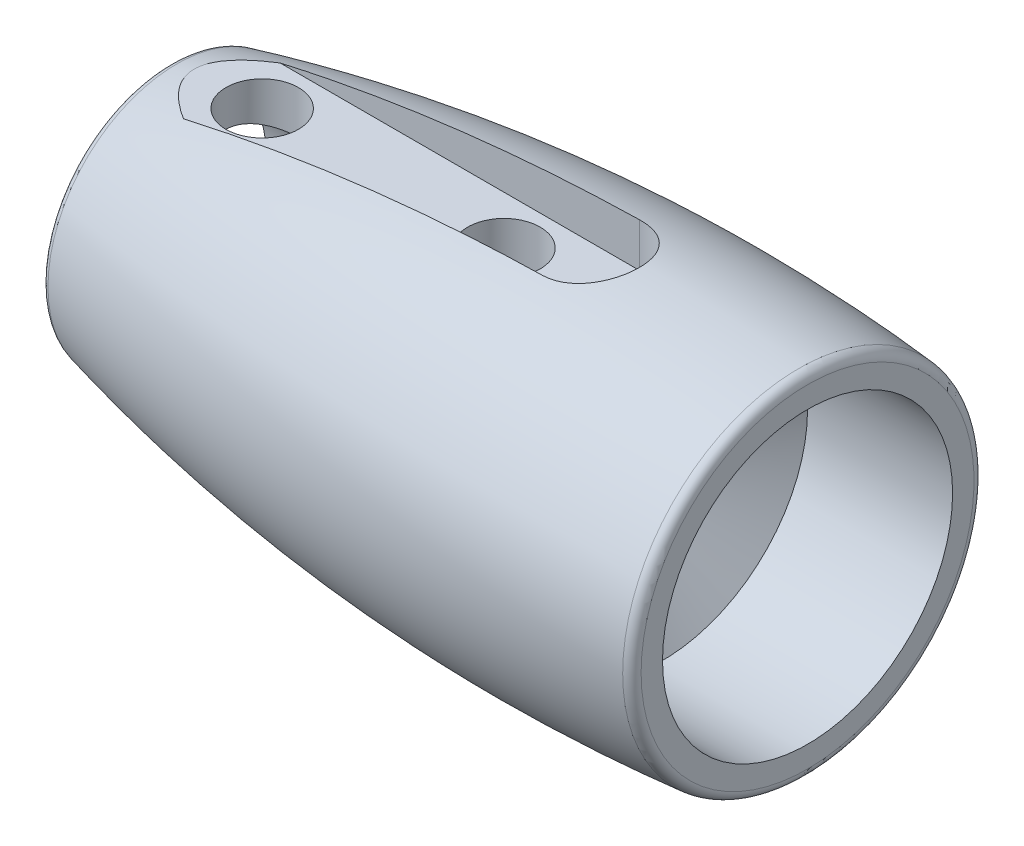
ISO-10303-21;
HEADER;
FILE_DESCRIPTION(('STEP AP214'),'2;1');
FILE_NAME('part.step','',(''),(''),'','','');
FILE_SCHEMA(('AUTOMOTIVE_DESIGN { 1 0 10303 214 1 1 1 1 }'));
ENDSEC;
DATA;
#1=APPLICATION_CONTEXT('core data for automotive mechanical design processes');
#2=APPLICATION_PROTOCOL_DEFINITION('international standard','automotive_design',2000,#1);
#3=PRODUCT_CONTEXT('',#1,'mechanical');
#4=PRODUCT('Part','Part','',(#3));
#5=PRODUCT_RELATED_PRODUCT_CATEGORY('part','',(#4));
#6=PRODUCT_DEFINITION_FORMATION('','',#4);
#7=PRODUCT_DEFINITION_CONTEXT('part definition',#1,'design');
#8=PRODUCT_DEFINITION('design','',#6,#7);
#9=PRODUCT_DEFINITION_SHAPE('','',#8);
#10=(LENGTH_UNIT() NAMED_UNIT(*) SI_UNIT(.MILLI.,.METRE.));
#11=(NAMED_UNIT(*) PLANE_ANGLE_UNIT() SI_UNIT($,.RADIAN.));
#12=(NAMED_UNIT(*) SI_UNIT($,.STERADIAN.) SOLID_ANGLE_UNIT());
#13=UNCERTAINTY_MEASURE_WITH_UNIT(LENGTH_MEASURE(1.E-05),#10,'distance_accuracy_value','');
#14=(GEOMETRIC_REPRESENTATION_CONTEXT(3) GLOBAL_UNCERTAINTY_ASSIGNED_CONTEXT((#13)) GLOBAL_UNIT_ASSIGNED_CONTEXT((#10,
#11,#12)) REPRESENTATION_CONTEXT('',''));
#15=CARTESIAN_POINT('',(0.,0.,0.));
#16=DIRECTION('',(0.,0.,1.));
#17=DIRECTION('',(1.,0.,0.));
#18=AXIS2_PLACEMENT_3D('',#15,#16,#17);
#19=CARTESIAN_POINT('',(32.6950058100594,0.,0.));
#20=DIRECTION('',(-1.,0.,0.));
#21=DIRECTION('',(0.,0.,1.));
#22=AXIS2_PLACEMENT_3D('',#19,#20,#21);
#23=DEGENERATE_TOROIDAL_SURFACE('',#22,88.0404677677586,97.5414506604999,.F.);
#24=CARTESIAN_POINT('',(41.4784414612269,0.,0.));
#25=DIRECTION('',(-1.,0.,0.));
#26=DIRECTION('',(0.,0.,1.));
#27=AXIS2_PLACEMENT_3D('',#24,#25,#26);
#28=CIRCLE('',#27,9.10471150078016);
#29=CARTESIAN_POINT('',(41.4784414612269,0.,9.10471150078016));
#30=VERTEX_POINT('',#29);
#31=EDGE_CURVE('E180',#30,#30,#28,.T.);
#32=ORIENTED_EDGE('',*,*,#31,.T.);
#33=EDGE_LOOP('',(#32));
#34=FACE_BOUND('',#33,.T.);
#35=CARTESIAN_POINT('',(9.31356346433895,0.,0.));
#36=DIRECTION('',(1.,0.,0.));
#37=DIRECTION('',(0.,0.,-1.));
#38=AXIS2_PLACEMENT_3D('',#35,#36,#37);
#39=CIRCLE('',#38,6.65717080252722);
#40=CARTESIAN_POINT('',(9.31356346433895,0.,-6.65717080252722));
#41=VERTEX_POINT('',#40);
#42=EDGE_CURVE('E143',#41,#41,#39,.T.);
#43=ORIENTED_EDGE('',*,*,#42,.T.);
#44=EDGE_LOOP('',(#43));
#45=FACE_BOUND('',#44,.T.);
#46=CARTESIAN_POINT('',(30.7332173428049,9.14571783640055,2.499999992));
#47=CARTESIAN_POINT('',(30.8026983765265,9.14715790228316,2.50001340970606));
#48=CARTESIAN_POINT('',(30.8721590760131,9.14932693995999,2.49711466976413));
#49=CARTESIAN_POINT('',(31.0105304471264,9.15505321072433,2.48556179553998));
#50=CARTESIAN_POINT('',(31.0794412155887,9.15861019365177,2.47690869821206));
#51=CARTESIAN_POINT('',(31.2160973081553,9.16703507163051,2.4539380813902));
#52=CARTESIAN_POINT('',(31.2838446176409,9.17190043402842,2.43963148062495));
#53=CARTESIAN_POINT('',(31.4178151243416,9.18282213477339,2.40549050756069));
#54=CARTESIAN_POINT('',(31.4840382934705,9.18887849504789,2.38565603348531));
#55=CARTESIAN_POINT('',(31.679714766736,9.20861847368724,2.3180850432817));
#56=CARTESIAN_POINT('',(31.8063201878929,9.22388238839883,2.26225632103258));
#57=CARTESIAN_POINT('',(32.0483058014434,9.25709868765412,2.13074410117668));
#58=CARTESIAN_POINT('',(32.1636829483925,9.27505179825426,2.05505523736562));
#59=CARTESIAN_POINT('',(32.3825258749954,9.31225288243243,1.88416572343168));
#60=CARTESIAN_POINT('',(32.4857105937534,9.3315194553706,1.78860842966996));
#61=CARTESIAN_POINT('',(32.6747224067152,9.36907514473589,1.58145558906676));
#62=CARTESIAN_POINT('',(32.7605471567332,9.38736412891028,1.46985787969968));
#63=CARTESIAN_POINT('',(32.9132130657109,9.42127971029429,1.23232261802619));
#64=CARTESIAN_POINT('',(32.9798516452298,9.43687724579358,1.10625039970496));
#65=CARTESIAN_POINT('',(33.090860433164,9.46352643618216,0.844214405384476));
#66=CARTESIAN_POINT('',(33.1352353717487,9.47457905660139,0.708252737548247));
#67=CARTESIAN_POINT('',(33.1994624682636,9.4907543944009,0.433640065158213));
#68=CARTESIAN_POINT('',(33.2198579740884,9.49600832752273,0.29512395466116));
#69=CARTESIAN_POINT('',(33.237253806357,9.50048245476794,0.016540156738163));
#70=CARTESIAN_POINT('',(33.2342571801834,9.49970343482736,-0.123527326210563));
#71=CARTESIAN_POINT('',(33.2053175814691,9.49228316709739,-0.397880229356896));
#72=CARTESIAN_POINT('',(33.1798959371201,9.48577511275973,-0.532224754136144));
#73=CARTESIAN_POINT('',(33.1076595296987,9.4677361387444,-0.794670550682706));
#74=CARTESIAN_POINT('',(33.0608438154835,9.4562049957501,-0.92277154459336));
#75=CARTESIAN_POINT('',(32.9467072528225,9.42912433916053,-1.17052645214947));
#76=CARTESIAN_POINT('',(32.8791930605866,9.41353715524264,-1.29008701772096));
#77=CARTESIAN_POINT('',(32.7257441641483,9.37992173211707,-1.51635332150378));
#78=CARTESIAN_POINT('',(32.6398067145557,9.36189312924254,-1.62305714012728));
#79=CARTESIAN_POINT('',(32.4490766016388,9.32460205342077,-1.82379341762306));
#80=CARTESIAN_POINT('',(32.3438166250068,9.30531906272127,-1.91737841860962));
#81=CARTESIAN_POINT('',(32.1189183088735,9.26795135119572,-2.08569311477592));
#82=CARTESIAN_POINT('',(31.9992754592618,9.24986700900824,-2.16041687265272));
#83=CARTESIAN_POINT('',(31.7477304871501,9.21661577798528,-2.28939443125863));
#84=CARTESIAN_POINT('',(31.6157319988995,9.20147524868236,-2.34346712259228));
#85=CARTESIAN_POINT('',(31.3441396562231,9.17592497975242,-2.42841309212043));
#86=CARTESIAN_POINT('',(31.204557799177,9.1655079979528,-2.45932193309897));
#87=CARTESIAN_POINT('',(31.0086590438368,9.15504780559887,-2.48541904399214));
#88=CARTESIAN_POINT('',(30.9536893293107,9.15255816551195,-2.49089095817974));
#89=CARTESIAN_POINT('',(30.8435639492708,9.14846854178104,-2.49817945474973));
#90=CARTESIAN_POINT('',(30.7884087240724,9.14686713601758,-2.5000018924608));
#91=CARTESIAN_POINT('',(30.7332173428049,9.14571783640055,-2.499999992));
#92=B_SPLINE_CURVE_WITH_KNOTS('',3,(#46,#47,#48,#49,#50,#51,#52,#53,#54,#55,#56,#57,#58,#59,#60,
#61,#62,#63,#64,#65,#66,#67,#68,#69,#70,#71,#72,#73,#74,#75,#76,#77,#78,#79,#80,#81,#82,#83,#84,
#85,#86,#87,#88,#89,#90,#91),.UNSPECIFIED.,.F.,.F.,(4,2,2,2,2,2,2,2,2,2,2,2,2,2,2,2,2,2,2,2,2,2,
4),(0.,0.208414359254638,0.41679117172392,0.624767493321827,0.832747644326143,1.24827091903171,
1.66390658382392,2.08777141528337,2.51169344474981,2.93993983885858,3.36809520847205,
3.78634969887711,4.20454970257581,4.61327645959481,5.02202138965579,5.43470713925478,
5.84745442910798,6.27195739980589,6.69659383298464,7.12487318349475,7.55249365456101,
7.71828453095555,7.88380919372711),.UNSPECIFIED.);
#93=CARTESIAN_POINT('',(30.7334173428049,9.14572200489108,2.5));
#94=VERTEX_POINT('',#93);
#95=CARTESIAN_POINT('',(30.7334173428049,9.14572200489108,-2.5));
#96=VERTEX_POINT('',#95);
#97=EDGE_CURVE('E64',#94,#96,#92,.T.);
#98=ORIENTED_EDGE('',*,*,#97,.F.);
#99=CARTESIAN_POINT('',(19.820833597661,8.27838672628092,2.5));
#100=CARTESIAN_POINT('',(21.0866418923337,8.45444425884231,2.5));
#101=CARTESIAN_POINT('',(22.3560717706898,8.60413413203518,2.5));
#102=CARTESIAN_POINT('',(24.9001325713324,8.85119736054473,2.5));
#103=CARTESIAN_POINT('',(26.1747639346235,8.9485661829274,2.5));
#104=CARTESIAN_POINT('',(28.7288311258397,9.09126248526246,2.5));
#105=CARTESIAN_POINT('',(30.0082712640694,9.13651315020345,2.5));
#106=CARTESIAN_POINT('',(32.5678185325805,9.17478966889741,2.5));
#107=CARTESIAN_POINT('',(33.8479256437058,9.16781694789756,2.5));
#108=CARTESIAN_POINT('',(37.2376749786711,9.08014654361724,2.5));
#109=CARTESIAN_POINT('',(39.3464121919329,8.95453121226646,2.5));
#110=CARTESIAN_POINT('',(42.4997265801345,8.65906867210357,2.5));
#111=CARTESIAN_POINT('',(43.549645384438,8.54266869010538,2.5));
#112=CARTESIAN_POINT('',(45.6449071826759,8.27392926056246,2.5));
#113=CARTESIAN_POINT('',(46.6902503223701,8.12159096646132,2.5));
#114=CARTESIAN_POINT('',(48.772793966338,7.78096597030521,2.5));
#115=CARTESIAN_POINT('',(49.8100069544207,7.59275537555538,2.5));
#116=CARTESIAN_POINT('',(51.8772024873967,7.17949174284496,2.5));
#117=CARTESIAN_POINT('',(52.9071844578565,6.95443581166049,2.5));
#118=CARTESIAN_POINT('',(54.4446339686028,6.58842266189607,2.5));
#119=CARTESIAN_POINT('',(54.955541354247,6.46176945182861,2.5));
#120=CARTESIAN_POINT('',(55.9748259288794,6.19867580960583,2.5));
#121=CARTESIAN_POINT('',(56.4832031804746,6.06223562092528,2.5));
#122=CARTESIAN_POINT('',(57.4970385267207,5.77920607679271,2.5));
#123=CARTESIAN_POINT('',(58.0024970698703,5.63261832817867,2.5));
#124=CARTESIAN_POINT('',(59.0101636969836,5.32871023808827,2.5));
#125=CARTESIAN_POINT('',(59.5123719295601,5.17139039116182,2.5));
#126=CARTESIAN_POINT('',(60.3197875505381,4.90811676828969,2.5));
#127=CARTESIAN_POINT('',(60.626179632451,4.80578696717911,2.5));
#128=CARTESIAN_POINT('',(61.237360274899,4.59643514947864,2.5));
#129=CARTESIAN_POINT('',(61.5421488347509,4.48941313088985,2.5));
#130=CARTESIAN_POINT('',(62.150352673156,4.27009774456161,2.5));
#131=CARTESIAN_POINT('',(62.4537651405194,4.1577965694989,2.5));
#132=CARTESIAN_POINT('',(63.0584017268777,3.92749465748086,2.5));
#133=CARTESIAN_POINT('',(63.3596259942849,3.80949431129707,2.5));
#134=CARTESIAN_POINT('',(63.9622127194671,3.56579482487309,2.5));
#135=CARTESIAN_POINT('',(64.2635504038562,3.44003428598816,2.5));
#136=CARTESIAN_POINT('',(64.8628666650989,3.18043206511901,2.5));
#137=CARTESIAN_POINT('',(65.1608441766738,3.04658790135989,2.5));
#138=CARTESIAN_POINT('',(65.603753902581,2.83828431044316,2.5));
#139=CARTESIAN_POINT('',(65.7505096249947,2.76769871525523,2.5));
#140=CARTESIAN_POINT('',(66.0425350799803,2.62352390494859,2.5));
#141=CARTESIAN_POINT('',(66.1878048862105,2.54993483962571,2.5));
#142=CARTESIAN_POINT('',(66.4764030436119,2.39921745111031,2.5));
#143=CARTESIAN_POINT('',(66.6197323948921,2.32209104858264,2.5));
#144=CARTESIAN_POINT('',(66.9039387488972,2.16346413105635,2.5));
#145=CARTESIAN_POINT('',(67.0448161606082,2.08196435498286,2.5));
#146=CARTESIAN_POINT('',(67.2547462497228,1.95484193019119,2.5));
#147=CARTESIAN_POINT('',(67.325049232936,1.9112866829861,2.5));
#148=CARTESIAN_POINT('',(67.4645935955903,1.82250889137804,2.5));
#149=CARTESIAN_POINT('',(67.5338349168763,1.77728625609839,2.5));
#150=CARTESIAN_POINT('',(67.740066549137,1.63847706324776,2.5));
#151=CARTESIAN_POINT('',(67.8751655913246,1.54198668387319,2.5));
#152=CARTESIAN_POINT('',(68.0703640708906,1.39008695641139,2.5));
#153=CARTESIAN_POINT('',(68.1336419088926,1.33876143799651,2.5));
#154=CARTESIAN_POINT('',(68.2574936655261,1.23296041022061,2.5));
#155=CARTESIAN_POINT('',(68.3180686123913,1.17848611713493,2.5));
#156=CARTESIAN_POINT('',(68.4353075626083,1.06595182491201,2.5));
#157=CARTESIAN_POINT('',(68.4919876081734,1.00790866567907,2.5));
#158=CARTESIAN_POINT('',(68.6001987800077,0.887245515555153,2.5));
#159=CARTESIAN_POINT('',(68.6517371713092,0.824632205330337,2.5));
#160=CARTESIAN_POINT('',(68.7201488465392,0.731124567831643,2.5));
#161=CARTESIAN_POINT('',(68.7400623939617,0.702450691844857,2.5));
#162=CARTESIAN_POINT('',(68.778244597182,0.64402212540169,2.5));
#163=CARTESIAN_POINT('',(68.7965129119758,0.61426721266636,2.5));
#164=CARTESIAN_POINT('',(68.8484283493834,0.523281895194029,2.5));
#165=CARTESIAN_POINT('',(68.8791846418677,0.460332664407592,2.5));
#166=CARTESIAN_POINT('',(68.9303947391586,0.329178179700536,2.5));
#167=CARTESIAN_POINT('',(68.9506924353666,0.260909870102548,2.5));
#168=CARTESIAN_POINT('',(68.9771641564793,0.121701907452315,2.5));
#169=CARTESIAN_POINT('',(68.9833698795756,0.050768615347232,2.5));
#170=CARTESIAN_POINT('',(68.9807634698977,-0.0810424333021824,2.5));
#171=CARTESIAN_POINT('',(68.9738916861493,-0.141966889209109,2.5));
#172=CARTESIAN_POINT('',(68.9498346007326,-0.261748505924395,2.5));
#173=CARTESIAN_POINT('',(68.9326363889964,-0.32060298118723,2.5));
#174=CARTESIAN_POINT('',(68.8811990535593,-0.458266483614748,2.5));
#175=CARTESIAN_POINT('',(68.8428814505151,-0.535522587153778,2.5));
#176=CARTESIAN_POINT('',(68.755052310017,-0.68334502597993,2.5));
#177=CARTESIAN_POINT('',(68.7055093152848,-0.753891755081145,2.5));
#178=CARTESIAN_POINT('',(68.5839462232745,-0.908328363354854,2.5));
#179=CARTESIAN_POINT('',(68.5095408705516,-0.990306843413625,2.5));
#180=CARTESIAN_POINT('',(68.353241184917,-1.14688185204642,2.5));
#181=CARTESIAN_POINT('',(68.2713317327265,-1.22146281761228,2.5));
#182=CARTESIAN_POINT('',(68.1021460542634,-1.36530734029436,2.5));
#183=CARTESIAN_POINT('',(68.0148397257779,-1.43453509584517,2.5));
#184=CARTESIAN_POINT('',(67.8369298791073,-1.56837145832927,2.5));
#185=CARTESIAN_POINT('',(67.7463297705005,-1.63298464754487,2.5));
#186=CARTESIAN_POINT('',(67.5582992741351,-1.76157827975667,2.5));
#187=CARTESIAN_POINT('',(67.4607489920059,-1.82538239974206,2.5));
#188=CARTESIAN_POINT('',(67.2636122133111,-1.94977462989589,2.5));
#189=CARTESIAN_POINT('',(67.1640254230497,-2.01036227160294,2.5));
#190=CARTESIAN_POINT('',(66.8628128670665,-2.18822216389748,2.5));
#191=CARTESIAN_POINT('',(66.6588422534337,-2.30152012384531,2.5));
#192=CARTESIAN_POINT('',(66.2463586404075,-2.52068779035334,2.5));
#193=CARTESIAN_POINT('',(66.0378356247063,-2.62653836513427,2.5));
#194=CARTESIAN_POINT('',(65.6179218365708,-2.83219230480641,2.5));
#195=CARTESIAN_POINT('',(65.4065320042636,-2.93199759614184,2.5));
#196=CARTESIAN_POINT('',(64.9813076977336,-3.12681743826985,2.5));
#197=CARTESIAN_POINT('',(64.7674709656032,-3.22182703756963,2.5));
#198=CARTESIAN_POINT('',(64.3379943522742,-3.40771154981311,2.5));
#199=CARTESIAN_POINT('',(64.1223543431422,-3.49858616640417,2.5));
#200=CARTESIAN_POINT('',(63.68991672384,-3.67659555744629,2.5));
#201=CARTESIAN_POINT('',(63.4731213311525,-3.76373572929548,2.5));
#202=CARTESIAN_POINT('',(63.0382721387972,-3.93480219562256,2.5));
#203=CARTESIAN_POINT('',(62.8202183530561,-4.01872852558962,2.5));
#204=CARTESIAN_POINT('',(62.1649269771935,-4.26594460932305,2.5));
#205=CARTESIAN_POINT('',(61.7260430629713,-4.42488210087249,2.5));
#206=CARTESIAN_POINT('',(60.8447497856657,-4.7327043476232,2.5));
#207=CARTESIAN_POINT('',(60.4023401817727,-4.88158840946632,2.5));
#208=CARTESIAN_POINT('',(59.5144580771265,-5.17026950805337,2.5));
#209=CARTESIAN_POINT('',(59.0689849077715,-5.31006448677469,2.5));
#210=CARTESIAN_POINT('',(58.175454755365,-5.58115191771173,2.5));
#211=CARTESIAN_POINT('',(57.7273976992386,-5.71244412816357,2.5));
#212=CARTESIAN_POINT('',(56.3784834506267,-6.09460150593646,2.5));
#213=CARTESIAN_POINT('',(55.4741643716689,-6.33333422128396,2.5));
#214=CARTESIAN_POINT('',(53.6582223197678,-6.78047256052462,2.5));
#215=CARTESIAN_POINT('',(52.7466002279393,-6.98888178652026,2.5));
#216=CARTESIAN_POINT('',(50.9174400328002,-7.37639591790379,2.5));
#217=CARTESIAN_POINT('',(49.9999038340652,-7.55550981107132,2.5));
#218=CARTESIAN_POINT('',(48.1597079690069,-7.88510360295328,2.5));
#219=CARTESIAN_POINT('',(47.2370481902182,-8.0355828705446,2.5));
#220=CARTESIAN_POINT('',(44.4641851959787,-8.44441548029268,2.5));
#221=CARTESIAN_POINT('',(42.6076537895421,-8.66046764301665,2.5));
#222=CARTESIAN_POINT('',(38.1269659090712,-9.04616010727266,2.5));
#223=CARTESIAN_POINT('',(35.4978695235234,-9.16113662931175,2.5));
#224=CARTESIAN_POINT('',(31.5537443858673,-9.1684472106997,2.5));
#225=CARTESIAN_POINT('',(30.2382775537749,-9.14330274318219,2.5));
#226=CARTESIAN_POINT('',(27.6094944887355,-9.03781407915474,2.5));
#227=CARTESIAN_POINT('',(26.2961781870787,-8.95747168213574,2.5));
#228=CARTESIAN_POINT('',(23.6748519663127,-8.74149551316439,2.5));
#229=CARTESIAN_POINT('',(22.3668395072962,-8.6058924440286,2.5));
#230=CARTESIAN_POINT('',(19.7576920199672,-8.27904006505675,2.5));
#231=CARTESIAN_POINT('',(18.4565574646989,-8.08778697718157,2.5));
#232=CARTESIAN_POINT('',(15.864994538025,-7.64912707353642,2.5));
#233=CARTESIAN_POINT('',(14.5745570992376,-7.40177426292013,2.5));
#234=CARTESIAN_POINT('',(12.6484247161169,-6.98740150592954,2.5));
#235=CARTESIAN_POINT('',(12.0080011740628,-6.84206207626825,2.5));
#236=CARTESIAN_POINT('',(10.7307096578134,-6.53655354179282,2.5));
#237=CARTESIAN_POINT('',(10.0938415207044,-6.37638512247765,2.5));
#238=CARTESIAN_POINT('',(9.06016360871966,-6.10306128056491,2.5));
#239=CARTESIAN_POINT('',(8.66211675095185,-5.99456086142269,2.5));
#240=CARTESIAN_POINT('',(7.86779776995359,-5.77128311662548,2.5));
#241=CARTESIAN_POINT('',(7.4715255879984,-5.65650600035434,2.5));
#242=CARTESIAN_POINT('',(6.68082268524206,-5.42036503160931,2.5));
#243=CARTESIAN_POINT('',(6.28639252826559,-5.29899928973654,2.5));
#244=CARTESIAN_POINT('',(5.49973470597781,-5.04932738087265,2.5));
#245=CARTESIAN_POINT('',(5.1075070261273,-4.9210212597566,2.5));
#246=CARTESIAN_POINT('',(4.32595470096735,-4.65704500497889,2.5));
#247=CARTESIAN_POINT('',(3.93662761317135,-4.52138211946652,2.5));
#248=CARTESIAN_POINT('',(3.16093204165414,-4.24174791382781,2.5));
#249=CARTESIAN_POINT('',(2.77456377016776,-4.09777600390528,2.5));
#250=CARTESIAN_POINT('',(2.00573716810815,-3.80036482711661,2.5));
#251=CARTESIAN_POINT('',(1.62327655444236,-3.64693150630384,2.5));
#252=CARTESIAN_POINT('',(1.05328907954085,-3.4080285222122,2.5));
#253=CARTESIAN_POINT('',(0.863922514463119,-3.32694083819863,2.5));
#254=CARTESIAN_POINT('',(0.486658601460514,-3.16142258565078,2.5));
#255=CARTESIAN_POINT('',(0.298761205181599,-3.07699212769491,2.5));
#256=CARTESIAN_POINT('',(-0.074142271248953,-2.90473978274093,2.5));
#257=CARTESIAN_POINT('',(-0.25915884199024,-2.81694066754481,2.5));
#258=CARTESIAN_POINT('',(-0.626967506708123,-2.63669883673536,2.5));
#259=CARTESIAN_POINT('',(-0.809759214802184,-2.54425532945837,2.5));
#260=CARTESIAN_POINT('',(-1.17187372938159,-2.35383025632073,2.5));
#261=CARTESIAN_POINT('',(-1.35120396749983,-2.25586288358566,2.5));
#262=CARTESIAN_POINT('',(-1.70557025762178,-2.05248568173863,2.5));
#263=CARTESIAN_POINT('',(-1.88060792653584,-1.94707871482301,2.5));
#264=CARTESIAN_POINT('',(-2.16727051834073,-1.76245698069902,2.5));
#265=CARTESIAN_POINT('',(-2.28073078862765,-1.68610194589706,2.5));
#266=CARTESIAN_POINT('',(-2.50370875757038,-1.52712926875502,2.5));
#267=CARTESIAN_POINT('',(-2.61321532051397,-1.44449570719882,2.5));
#268=CARTESIAN_POINT('',(-2.77827155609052,-1.30971783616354,2.5));
#269=CARTESIAN_POINT('',(-2.83612033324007,-1.26039570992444,2.5));
#270=CARTESIAN_POINT('',(-2.94910259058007,-1.15874755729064,2.5));
#271=CARTESIAN_POINT('',(-3.00423706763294,-1.10642264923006,2.5));
#272=CARTESIAN_POINT('',(-3.11069765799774,-0.998314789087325,2.5));
#273=CARTESIAN_POINT('',(-3.16203500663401,-0.942543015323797,2.5));
#274=CARTESIAN_POINT('',(-3.25960510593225,-0.826743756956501,2.5));
#275=CARTESIAN_POINT('',(-3.30584413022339,-0.76672165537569,2.5));
#276=CARTESIAN_POINT('',(-3.386753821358,-0.648044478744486,2.5));
#277=CARTESIAN_POINT('',(-3.42212334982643,-0.589874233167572,2.5));
#278=CARTESIAN_POINT('',(-3.48475596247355,-0.469261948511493,2.5));
#279=CARTESIAN_POINT('',(-3.51202474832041,-0.406822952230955,2.5));
#280=CARTESIAN_POINT('',(-3.55598504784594,-0.277191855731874,2.5));
#281=CARTESIAN_POINT('',(-3.57252074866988,-0.209944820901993,2.5));
#282=CARTESIAN_POINT('',(-3.59176057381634,-0.0735184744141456,2.5));
#283=CARTESIAN_POINT('',(-3.59448883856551,-0.00434274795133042,2.5));
#284=CARTESIAN_POINT('',(-3.58629825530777,0.123630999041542,2.5));
#285=CARTESIAN_POINT('',(-3.57719234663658,0.182556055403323,2.5));
#286=CARTESIAN_POINT('',(-3.54957201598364,0.298159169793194,2.5));
#287=CARTESIAN_POINT('',(-3.53104621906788,0.354834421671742,2.5));
#288=CARTESIAN_POINT('',(-3.47502928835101,0.493234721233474,2.5));
#289=CARTESIAN_POINT('',(-3.43268434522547,0.572964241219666,2.5));
#290=CARTESIAN_POINT('',(-3.33662201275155,0.725212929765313,2.5));
#291=CARTESIAN_POINT('',(-3.28286968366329,0.797708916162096,2.5));
#292=CARTESIAN_POINT('',(-3.14801797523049,0.96072669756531,2.5));
#293=CARTESIAN_POINT('',(-3.0639171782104,1.04872347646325,2.5));
#294=CARTESIAN_POINT('',(-2.88774455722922,1.21645015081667,2.5));
#295=CARTESIAN_POINT('',(-2.79565553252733,1.2961613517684,2.5));
#296=CARTESIAN_POINT('',(-2.60581580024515,1.44975515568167,2.5));
#297=CARTESIAN_POINT('',(-2.50803287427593,1.52359756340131,2.5));
#298=CARTESIAN_POINT('',(-2.35879637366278,1.63061601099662,2.5));
#299=CARTESIAN_POINT('',(-2.30865020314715,1.66564764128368,2.5));
#300=CARTESIAN_POINT('',(-2.20760979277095,1.73461447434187,2.5));
#301=CARTESIAN_POINT('',(-2.15671556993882,1.76854970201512,2.5));
#302=CARTESIAN_POINT('',(-1.99337880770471,1.8752354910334,2.5));
#303=CARTESIAN_POINT('',(-1.87973203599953,1.94614389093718,2.5));
#304=CARTESIAN_POINT('',(-1.65020109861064,2.08425674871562,2.5));
#305=CARTESIAN_POINT('',(-1.53431653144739,2.15146053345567,2.5));
#306=CARTESIAN_POINT('',(-1.30076872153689,2.28285590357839,2.5));
#307=CARTESIAN_POINT('',(-1.18310449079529,2.34704572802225,2.5));
#308=CARTESIAN_POINT('',(-0.94640856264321,2.47285810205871,2.5));
#309=CARTESIAN_POINT('',(-0.827376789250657,2.53448050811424,2.5));
#310=CARTESIAN_POINT('',(-0.468040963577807,2.71635742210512,2.5));
#311=CARTESIAN_POINT('',(-0.226063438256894,2.83330802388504,2.5));
#312=CARTESIAN_POINT('',(0.26095072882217,3.06037457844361,2.5));
#313=CARTESIAN_POINT('',(0.505986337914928,3.17049276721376,2.5));
#314=CARTESIAN_POINT('',(0.998578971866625,3.38520971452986,2.5));
#315=CARTESIAN_POINT('',(1.24613700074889,3.4898061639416,2.5));
#316=CARTESIAN_POINT('',(1.74321649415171,3.69426418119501,2.5));
#317=CARTESIAN_POINT('',(1.9927381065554,3.79412538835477,2.5));
#318=CARTESIAN_POINT('',(2.49304149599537,3.98953203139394,2.5));
#319=CARTESIAN_POINT('',(2.74382089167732,4.08508357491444,2.5));
#320=CARTESIAN_POINT('',(3.24677190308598,4.27243208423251,2.5));
#321=CARTESIAN_POINT('',(3.49894350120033,4.36422909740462,2.5));
#322=CARTESIAN_POINT('',(4.07655479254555,4.57004325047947,2.5));
#323=CARTESIAN_POINT('',(4.40239482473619,4.68293758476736,2.5));
#324=CARTESIAN_POINT('',(5.05584339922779,4.90349434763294,2.5));
#325=CARTESIAN_POINT('',(5.38345198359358,5.0111566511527,2.5));
#326=CARTESIAN_POINT('',(6.36868233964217,5.32682917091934,2.5));
#327=CARTESIAN_POINT('',(7.02866392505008,5.52750916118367,2.5));
#328=CARTESIAN_POINT('',(8.35436267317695,5.91119537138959,2.5));
#329=CARTESIAN_POINT('',(9.02008447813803,6.0941854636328,2.5));
#330=CARTESIAN_POINT('',(10.3559145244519,6.44324616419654,2.5));
#331=CARTESIAN_POINT('',(11.0260225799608,6.60931748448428,2.5));
#332=CARTESIAN_POINT('',(12.3686651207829,6.92482409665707,2.5));
#333=CARTESIAN_POINT('',(13.0411916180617,7.0742934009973,2.5));
#334=CARTESIAN_POINT('',(14.3895653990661,7.35736930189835,2.5));
#335=CARTESIAN_POINT('',(15.0654127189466,7.49097572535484,2.5));
#336=CARTESIAN_POINT('',(17.0967727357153,7.86829702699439,2.5));
#337=CARTESIAN_POINT('',(18.4567001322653,8.08865343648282,2.5));
#338=CARTESIAN_POINT('',(19.820833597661,8.27838672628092,2.5));
#339=B_SPLINE_CURVE_WITH_KNOTS('',3,(#99,#100,#101,#102,#103,#104,#105,#106,#107,#108,#109,#110,
#111,#112,#113,#114,#115,#116,#117,#118,#119,#120,#121,#122,#123,#124,#125,#126,#127,#128,#129,
#130,#131,#132,#133,#134,#135,#136,#137,#138,#139,#140,#141,#142,#143,#144,#145,#146,#147,#148,
#149,#150,#151,#152,#153,#154,#155,#156,#157,#158,#159,#160,#161,#162,#163,#164,#165,#166,#167,
#168,#169,#170,#171,#172,#173,#174,#175,#176,#177,#178,#179,#180,#181,#182,#183,#184,#185,#186,
#187,#188,#189,#190,#191,#192,#193,#194,#195,#196,#197,#198,#199,#200,#201,#202,#203,#204,#205,
#206,#207,#208,#209,#210,#211,#212,#213,#214,#215,#216,#217,#218,#219,#220,#221,#222,#223,#224,
#225,#226,#227,#228,#229,#230,#231,#232,#233,#234,#235,#236,#237,#238,#239,#240,#241,#242,#243,
#244,#245,#246,#247,#248,#249,#250,#251,#252,#253,#254,#255,#256,#257,#258,#259,#260,#261,#262,
#263,#264,#265,#266,#267,#268,#269,#270,#271,#272,#273,#274,#275,#276,#277,#278,#279,#280,#281,
#282,#283,#284,#285,#286,#287,#288,#289,#290,#291,#292,#293,#294,#295,#296,#297,#298,#299,#300,
#301,#302,#303,#304,#305,#306,#307,#308,#309,#310,#311,#312,#313,#314,#315,#316,#317,#318,#319,
#320,#321,#322,#323,#324,#325,#326,#327,#328,#329,#330,#331,#332,#333,#334,#335,#336,#337,#338),
.UNSPECIFIED.,.T.,.F.,(4,2,2,2,2,2,2,2,2,2,2,2,2,2,2,2,2,2,2,2,2,2,2,2,2,2,2,2,2,2,2,2,2,2,2,2,
2,2,2,2,2,2,2,2,2,2,2,2,2,2,2,2,2,2,2,2,2,2,2,2,2,2,2,2,2,2,2,2,2,2,2,2,2,2,2,2,2,2,2,2,2,2,2,2,
2,2,2,2,2,2,2,2,2,2,2,2,2,2,2,2,2,2,2,2,2,2,2,2,2,2,2,2,2,2,2,2,2,2,2,4),(0.,3.83363030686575,
7.6675926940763,11.5071986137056,15.3466997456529,21.6784565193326,24.8470401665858,
28.0155221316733,31.1773551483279,34.3394365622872,35.9184741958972,37.4974725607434,
39.0762214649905,40.6548976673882,41.6239515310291,42.5930058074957,43.5635413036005,
44.5340103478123,45.513505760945,46.493303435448,46.9818219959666,47.4703162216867,
47.9585482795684,48.4466981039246,48.6947797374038,48.9428749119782,49.4404568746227,
49.6848109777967,49.9290713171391,50.1722564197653,50.4150928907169,50.5197750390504,
50.6244788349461,50.8338929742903,51.0463484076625,51.2583254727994,51.4412715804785,
51.6244468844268,51.8816818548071,52.139646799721,52.4709782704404,52.802992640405,
53.1370637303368,53.470798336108,53.8204091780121,54.1700707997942,54.8697799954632,
55.571225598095,56.2724464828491,56.9743771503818,57.6763580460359,58.3772875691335,
59.0782093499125,60.4783806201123,61.8786483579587,63.2792320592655,64.6798555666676,
67.4851386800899,70.2900882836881,73.0941757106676,75.8983249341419,81.5022027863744,
89.3864889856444,93.3327034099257,97.2787891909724,101.222685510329,105.166849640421,
109.107232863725,111.077218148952,113.047112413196,114.284777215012,115.52240075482,
116.760381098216,117.99835325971,119.235127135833,120.471988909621,121.708081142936,
122.326048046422,122.943994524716,123.558320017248,124.172750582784,124.785668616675,
125.398352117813,125.808506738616,126.219738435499,126.447720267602,126.675617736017,
126.902811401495,127.129722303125,127.333492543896,127.537119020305,127.743639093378,
127.949797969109,128.127801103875,128.306019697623,128.57529104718,128.845399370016,
129.209658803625,129.574723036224,129.942103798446,130.125606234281,130.309104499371,
130.710863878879,131.112696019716,131.514760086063,131.91684660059,132.722962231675,
133.528812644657,134.334997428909,135.141243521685,135.946308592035,136.751363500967,
137.785841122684,138.820343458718,140.889490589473,142.960506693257,145.031435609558,
147.098040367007,149.16466767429,153.29608584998),.UNSPECIFIED.);
#340=CARTESIAN_POINT('',(12.1624478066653,6.875,2.5));
#341=VERTEX_POINT('',#340);
#342=EDGE_CURVE('E113',#341,#94,#339,.T.);
#343=ORIENTED_EDGE('',*,*,#342,.F.);
#344=CARTESIAN_POINT('',(10.2141567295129,6.875,0.));
#345=CARTESIAN_POINT('',(10.214177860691,6.875,0.109347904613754));
#346=CARTESIAN_POINT('',(10.2253423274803,6.875,0.218779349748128));
#347=CARTESIAN_POINT('',(10.2683150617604,6.875,0.433543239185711));
#348=CARTESIAN_POINT('',(10.3001688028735,6.875,0.538866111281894));
#349=CARTESIAN_POINT('',(10.3909765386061,6.875,0.769267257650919));
#350=CARTESIAN_POINT('',(10.454818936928,6.875,0.892376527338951));
#351=CARTESIAN_POINT('',(10.6008833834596,6.875,1.12705702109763));
#352=CARTESIAN_POINT('',(10.6831467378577,6.875,1.23860147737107));
#353=CARTESIAN_POINT('',(10.8533969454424,6.875,1.44313756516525));
#354=CARTESIAN_POINT('',(10.9404847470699,6.875,1.53689391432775));
#355=CARTESIAN_POINT('',(11.1223017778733,6.875,1.71675409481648));
#356=CARTESIAN_POINT('',(11.2170380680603,6.875,1.80285069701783));
#357=CARTESIAN_POINT('',(11.4122879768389,6.875,1.96868104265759));
#358=CARTESIAN_POINT('',(11.5128157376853,6.875,2.0483979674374));
#359=CARTESIAN_POINT('',(11.7180118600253,6.875,2.20217220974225));
#360=CARTESIAN_POINT('',(11.8226785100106,6.875,2.27623183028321));
#361=CARTESIAN_POINT('',(12.1034652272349,6.875,2.46555325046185));
#362=CARTESIAN_POINT('',(12.2823240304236,6.875,2.5767468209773));
#363=CARTESIAN_POINT('',(12.6460672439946,6.875,2.78887684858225));
#364=CARTESIAN_POINT('',(12.8309550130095,6.875,2.88980745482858));
#365=CARTESIAN_POINT('',(13.2054276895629,6.875,3.08338387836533));
#366=CARTESIAN_POINT('',(13.3950206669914,6.875,3.17601399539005));
#367=CARTESIAN_POINT('',(13.7775340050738,6.875,3.35413938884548));
#368=CARTESIAN_POINT('',(13.9704547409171,6.875,3.43963385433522));
#369=CARTESIAN_POINT('',(14.3597053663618,6.875,3.60482451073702));
#370=CARTESIAN_POINT('',(14.5560461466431,6.875,3.68449493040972));
#371=CARTESIAN_POINT('',(14.9508418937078,6.875,3.83841432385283));
#372=CARTESIAN_POINT('',(15.149296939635,6.875,3.91266309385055));
#373=CARTESIAN_POINT('',(15.5477013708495,6.875,4.056247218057));
#374=CARTESIAN_POINT('',(15.7476486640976,6.875,4.12558839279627));
#375=CARTESIAN_POINT('',(16.1489944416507,6.875,4.25992336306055));
#376=CARTESIAN_POINT('',(16.3503929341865,6.875,4.32491713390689));
#377=CARTESIAN_POINT('',(16.8875505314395,6.875,4.49246658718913));
#378=CARTESIAN_POINT('',(17.2243948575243,6.875,4.59155188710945));
#379=CARTESIAN_POINT('',(17.9007693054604,6.875,4.78014427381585));
#380=CARTESIAN_POINT('',(18.2402996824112,6.875,4.86965043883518));
#381=CARTESIAN_POINT('',(18.9216243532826,6.875,5.04006018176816));
#382=CARTESIAN_POINT('',(19.2634193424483,6.875,5.12096097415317));
#383=CARTESIAN_POINT('',(19.9487920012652,6.875,5.274845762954));
#384=CARTESIAN_POINT('',(20.2923697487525,6.875,5.34782941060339));
#385=CARTESIAN_POINT('',(21.3266298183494,6.875,5.55602792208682));
#386=CARTESIAN_POINT('',(22.019560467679,6.875,5.68017569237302));
#387=CARTESIAN_POINT('',(23.4094545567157,6.875,5.90207119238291));
#388=CARTESIAN_POINT('',(24.106417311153,6.875,5.99982328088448));
#389=CARTESIAN_POINT('',(25.5067021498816,6.875,6.17128014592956));
#390=CARTESIAN_POINT('',(26.2100386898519,6.875,6.24486645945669));
#391=CARTESIAN_POINT('',(27.6187864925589,6.875,6.36858356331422));
#392=CARTESIAN_POINT('',(28.3241978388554,6.875,6.41871339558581));
#393=CARTESIAN_POINT('',(29.7351631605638,6.875,6.4961992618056));
#394=CARTESIAN_POINT('',(30.4407152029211,6.875,6.52359064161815));
#395=CARTESIAN_POINT('',(31.8523888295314,6.875,6.55610957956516));
#396=CARTESIAN_POINT('',(32.5585104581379,6.875,6.56123519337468));
#397=CARTESIAN_POINT('',(34.030025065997,6.875,6.54878555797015));
#398=CARTESIAN_POINT('',(34.795402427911,6.875,6.529262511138));
#399=CARTESIAN_POINT('',(36.3249687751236,6.875,6.46381733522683));
#400=CARTESIAN_POINT('',(37.0891578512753,6.875,6.41789733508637));
#401=CARTESIAN_POINT('',(38.6175186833,6.875,6.29871967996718));
#402=CARTESIAN_POINT('',(39.3816846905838,6.875,6.2253876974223));
#403=CARTESIAN_POINT('',(40.9066076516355,6.875,6.05000907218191));
#404=CARTESIAN_POINT('',(41.6673651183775,6.875,5.94796690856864));
#405=CARTESIAN_POINT('',(43.1763758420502,6.875,5.71407088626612));
#406=CARTESIAN_POINT('',(43.9246773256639,6.875,5.58253346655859));
#407=CARTESIAN_POINT('',(45.0422302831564,6.875,5.35957722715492));
#408=CARTESIAN_POINT('',(45.4140580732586,6.875,5.28095209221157));
#409=CARTESIAN_POINT('',(46.1556349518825,6.875,5.11443225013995));
#410=CARTESIAN_POINT('',(46.525384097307,6.875,5.02653779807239));
#411=CARTESIAN_POINT('',(47.2607988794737,6.875,4.8409456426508));
#412=CARTESIAN_POINT('',(47.6264750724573,6.875,4.74328990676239));
#413=CARTESIAN_POINT('',(48.3546037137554,6.875,4.53663487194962));
#414=CARTESIAN_POINT('',(48.7170563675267,6.875,4.42763630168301));
#415=CARTESIAN_POINT('',(49.4373988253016,6.875,4.19666442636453));
#416=CARTESIAN_POINT('',(49.7952930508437,6.875,4.07470496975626));
#417=CARTESIAN_POINT('',(50.5053548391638,6.875,3.81522532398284));
#418=CARTESIAN_POINT('',(50.8575243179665,6.875,3.67771046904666));
#419=CARTESIAN_POINT('',(51.3211719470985,6.875,3.48151592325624));
#420=CARTESIAN_POINT('',(51.4363404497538,6.875,3.43151165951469));
#421=CARTESIAN_POINT('',(51.6656193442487,6.875,3.32913009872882));
#422=CARTESIAN_POINT('',(51.7797297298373,6.875,3.27675278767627));
#423=CARTESIAN_POINT('',(52.1203735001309,6.875,3.11566120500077));
#424=CARTESIAN_POINT('',(52.3450825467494,6.875,3.00304455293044));
#425=CARTESIAN_POINT('',(52.7880501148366,6.875,2.76478606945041));
#426=CARTESIAN_POINT('',(53.0062984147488,6.875,2.63912488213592));
#427=CARTESIAN_POINT('',(53.3257669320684,6.875,2.4382603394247));
#428=CARTESIAN_POINT('',(53.4308973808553,6.875,2.36927436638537));
#429=CARTESIAN_POINT('',(53.6378401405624,6.875,2.22651196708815));
#430=CARTESIAN_POINT('',(53.739653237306,6.875,2.1527366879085));
#431=CARTESIAN_POINT('',(53.9404406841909,6.875,1.99851299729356));
#432=CARTESIAN_POINT('',(54.0393540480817,6.875,1.91798458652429));
#433=CARTESIAN_POINT('',(54.2312736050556,6.875,1.75022294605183));
#434=CARTESIAN_POINT('',(54.3242836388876,6.875,1.66299415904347));
#435=CARTESIAN_POINT('',(54.5016528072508,6.875,1.48123984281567));
#436=CARTESIAN_POINT('',(54.586067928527,6.875,1.38676965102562));
#437=CARTESIAN_POINT('',(54.7436062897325,6.875,1.18895058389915));
#438=CARTESIAN_POINT('',(54.8167523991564,6.875,1.08562037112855));
#439=CARTESIAN_POINT('',(54.9355322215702,6.875,0.888484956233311));
#440=CARTESIAN_POINT('',(54.9837455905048,6.875,0.79625841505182));
#441=CARTESIAN_POINT('',(55.0659590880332,6.875,0.605593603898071));
#442=CARTESIAN_POINT('',(55.0999698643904,6.875,0.50716005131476));
#443=CARTESIAN_POINT('',(55.1505183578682,6.875,0.304682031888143));
#444=CARTESIAN_POINT('',(55.1668731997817,6.875,0.20059035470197));
#445=CARTESIAN_POINT('',(55.1791884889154,6.875,-0.00878911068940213));
#446=CARTESIAN_POINT('',(55.1751602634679,6.875,-0.114076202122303));
#447=CARTESIAN_POINT('',(55.1488835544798,6.875,-0.310543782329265));
#448=CARTESIAN_POINT('',(55.1286696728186,6.875,-0.402010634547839));
#449=CARTESIAN_POINT('',(55.0746696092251,6.875,-0.580814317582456));
#450=CARTESIAN_POINT('',(55.0408730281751,6.875,-0.668147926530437));
#451=CARTESIAN_POINT('',(54.9392503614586,6.875,-0.887462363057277));
#452=CARTESIAN_POINT('',(54.8630952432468,6.875,-1.01554808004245));
#453=CARTESIAN_POINT('',(54.6923826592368,6.875,-1.25879575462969));
#454=CARTESIAN_POINT('',(54.5977670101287,6.875,-1.37391498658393));
#455=CARTESIAN_POINT('',(54.3978381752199,6.875,-1.59127266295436));
#456=CARTESIAN_POINT('',(54.2926938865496,6.875,-1.6936692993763));
#457=CARTESIAN_POINT('',(54.0741881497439,6.875,-1.88937634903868));
#458=CARTESIAN_POINT('',(53.9608182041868,6.875,-1.98267712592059));
#459=CARTESIAN_POINT('',(53.7279856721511,6.875,-2.16187476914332));
#460=CARTESIAN_POINT('',(53.608508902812,6.875,-2.24775302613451));
#461=CARTESIAN_POINT('',(53.3652836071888,6.875,-2.41304375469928));
#462=CARTESIAN_POINT('',(53.241537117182,6.875,-2.49245924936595));
#463=CARTESIAN_POINT('',(52.8998357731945,6.875,-2.70147719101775));
#464=CARTESIAN_POINT('',(52.6786134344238,6.875,-2.82573054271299));
#465=CARTESIAN_POINT('',(52.2295386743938,6.875,-3.06171746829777));
#466=CARTESIAN_POINT('',(52.0016824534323,6.875,-3.17344368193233));
#467=CARTESIAN_POINT('',(51.5408287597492,6.875,-3.38687533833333));
#468=CARTESIAN_POINT('',(51.3078223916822,6.875,-3.48856146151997));
#469=CARTESIAN_POINT('',(50.838246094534,6.875,-3.68335669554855));
#470=CARTESIAN_POINT('',(50.6016757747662,6.875,-3.77646485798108));
#471=CARTESIAN_POINT('',(50.1246227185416,6.875,-3.95573468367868));
#472=CARTESIAN_POINT('',(49.8841265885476,6.875,-4.04186054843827));
#473=CARTESIAN_POINT('',(49.400891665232,6.875,-4.20757793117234));
#474=CARTESIAN_POINT('',(49.1581527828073,6.875,-4.28716918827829));
#475=CARTESIAN_POINT('',(48.6711340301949,6.875,-4.44041820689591));
#476=CARTESIAN_POINT('',(48.4268563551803,6.875,-4.51408296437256));
#477=CARTESIAN_POINT('',(47.936770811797,6.875,-4.65612285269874));
#478=CARTESIAN_POINT('',(47.6909629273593,6.875,-4.72449792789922));
#479=CARTESIAN_POINT('',(47.061091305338,6.875,-4.89304018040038));
#480=CARTESIAN_POINT('',(46.6761028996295,6.875,-4.98976048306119));
#481=CARTESIAN_POINT('',(45.9036244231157,6.875,-5.17268331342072));
#482=CARTESIAN_POINT('',(45.516134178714,6.875,-5.2588851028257));
#483=CARTESIAN_POINT('',(44.7390295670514,6.875,-5.42167833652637));
#484=CARTESIAN_POINT('',(44.3494146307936,6.875,-5.49826705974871));
#485=CARTESIAN_POINT('',(43.5685226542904,6.875,-5.6424722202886));
#486=CARTESIAN_POINT('',(43.1772455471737,6.875,-5.71008829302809));
#487=CARTESIAN_POINT('',(42.0001256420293,6.875,-5.90047135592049));
#488=CARTESIAN_POINT('',(41.2121996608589,6.875,-6.01052452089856));
#489=CARTESIAN_POINT('',(39.6326489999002,6.875,-6.19956376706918));
#490=CARTESIAN_POINT('',(38.8410241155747,6.875,-6.27854810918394));
#491=CARTESIAN_POINT('',(37.2572919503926,6.875,-6.40692061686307));
#492=CARTESIAN_POINT('',(36.4651903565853,6.875,-6.45637915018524));
#493=CARTESIAN_POINT('',(34.8797005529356,6.875,-6.52690393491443));
#494=CARTESIAN_POINT('',(34.0863122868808,6.875,-6.54796891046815));
#495=CARTESIAN_POINT('',(32.500153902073,6.875,-6.56205705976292));
#496=CARTESIAN_POINT('',(31.7073840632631,6.875,-6.55511105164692));
#497=CARTESIAN_POINT('',(30.1226511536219,6.875,-6.5131216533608));
#498=CARTESIAN_POINT('',(29.3306880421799,6.875,-6.47807975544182));
#499=CARTESIAN_POINT('',(27.5062749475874,6.875,-6.3642036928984));
#500=CARTESIAN_POINT('',(26.4744206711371,6.875,-6.27524767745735));
#501=CARTESIAN_POINT('',(24.9315482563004,6.875,-6.10292117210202));
#502=CARTESIAN_POINT('',(24.4182933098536,6.875,-6.03903242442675));
#503=CARTESIAN_POINT('',(23.3936761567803,6.875,-5.89762504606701));
#504=CARTESIAN_POINT('',(22.8823138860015,6.875,-5.82010688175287));
#505=CARTESIAN_POINT('',(21.6577950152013,6.875,-5.61668596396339));
#506=CARTESIAN_POINT('',(20.9457641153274,6.875,-5.48383395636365));
#507=CARTESIAN_POINT('',(19.8826788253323,6.875,-5.2605168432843));
#508=CARTESIAN_POINT('',(19.5290787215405,6.875,-5.18205448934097));
#509=CARTESIAN_POINT('',(18.8239365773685,6.875,-5.01640910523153));
#510=CARTESIAN_POINT('',(18.4723944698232,6.875,-4.92922636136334));
#511=CARTESIAN_POINT('',(17.6315177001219,6.875,-4.70845008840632));
#512=CARTESIAN_POINT('',(17.1433685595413,6.875,-4.57025056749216));
#513=CARTESIAN_POINT('',(16.416506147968,6.875,-4.3462425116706));
#514=CARTESIAN_POINT('',(16.175195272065,6.875,-4.26881821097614));
#515=CARTESIAN_POINT('',(15.6946705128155,6.875,-4.10772359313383));
#516=CARTESIAN_POINT('',(15.4554565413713,6.875,-4.0240535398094));
#517=CARTESIAN_POINT('',(14.8833792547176,6.875,-3.81439283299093));
#518=CARTESIAN_POINT('',(14.5517625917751,6.875,-3.6849704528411));
#519=CARTESIAN_POINT('',(13.8949990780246,6.875,-3.40875177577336));
#520=CARTESIAN_POINT('',(13.569865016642,6.875,-3.26192447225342));
#521=CARTESIAN_POINT('',(13.0812607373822,6.875,-3.02033076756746));
#522=CARTESIAN_POINT('',(12.9138027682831,6.875,-2.9336326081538));
#523=CARTESIAN_POINT('',(12.5829720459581,6.875,-2.75279597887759));
#524=CARTESIAN_POINT('',(12.4195982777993,6.875,-2.6586593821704));
#525=CARTESIAN_POINT('',(12.0987971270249,6.875,-2.46168496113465));
#526=CARTESIAN_POINT('',(11.941353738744,6.875,-2.35887341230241));
#527=CARTESIAN_POINT('',(11.6342726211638,6.875,-2.1422851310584));
#528=CARTESIAN_POINT('',(11.4846279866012,6.875,-2.02851836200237));
#529=CARTESIAN_POINT('',(11.2249135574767,6.875,-1.81058686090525));
#530=CARTESIAN_POINT('',(11.1128128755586,6.875,-1.70886824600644));
#531=CARTESIAN_POINT('',(10.8992192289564,6.875,-1.49416896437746));
#532=CARTESIAN_POINT('',(10.7977506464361,6.875,-1.38116352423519));
#533=CARTESIAN_POINT('',(10.6096339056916,6.875,-1.14002774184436));
#534=CARTESIAN_POINT('',(10.5232623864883,6.875,-1.01167580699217));
#535=CARTESIAN_POINT('',(10.377231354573,6.875,-0.74070302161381));
#536=CARTESIAN_POINT('',(10.3174106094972,6.875,-0.598174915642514));
#537=CARTESIAN_POINT('',(10.256191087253,6.875,-0.377196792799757));
#538=CARTESIAN_POINT('',(10.2405427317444,6.875,-0.302641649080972));
#539=CARTESIAN_POINT('',(10.2195182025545,6.875,-0.152071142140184));
#540=CARTESIAN_POINT('',(10.2141420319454,6.875,-0.0760557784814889));
#541=CARTESIAN_POINT('',(10.2141567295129,6.875,0.));
#542=B_SPLINE_CURVE_WITH_KNOTS('',3,(#344,#345,#346,#347,#348,#349,#350,#351,#352,#353,#354,
#355,#356,#357,#358,#359,#360,#361,#362,#363,#364,#365,#366,#367,#368,#369,#370,#371,#372,#373,
#374,#375,#376,#377,#378,#379,#380,#381,#382,#383,#384,#385,#386,#387,#388,#389,#390,#391,#392,
#393,#394,#395,#396,#397,#398,#399,#400,#401,#402,#403,#404,#405,#406,#407,#408,#409,#410,#411,
#412,#413,#414,#415,#416,#417,#418,#419,#420,#421,#422,#423,#424,#425,#426,#427,#428,#429,#430,
#431,#432,#433,#434,#435,#436,#437,#438,#439,#440,#441,#442,#443,#444,#445,#446,#447,#448,#449,
#450,#451,#452,#453,#454,#455,#456,#457,#458,#459,#460,#461,#462,#463,#464,#465,#466,#467,#468,
#469,#470,#471,#472,#473,#474,#475,#476,#477,#478,#479,#480,#481,#482,#483,#484,#485,#486,#487,
#488,#489,#490,#491,#492,#493,#494,#495,#496,#497,#498,#499,#500,#501,#502,#503,#504,#505,#506,
#507,#508,#509,#510,#511,#512,#513,#514,#515,#516,#517,#518,#519,#520,#521,#522,#523,#524,#525,
#526,#527,#528,#529,#530,#531,#532,#533,#534,#535,#536,#537,#538,#539,#540,#541),.UNSPECIFIED.,
.T.,.F.,(4,2,2,2,2,2,2,2,2,2,2,2,2,2,2,2,2,2,2,2,2,2,2,2,2,2,2,2,2,2,2,2,2,2,2,2,2,2,2,2,2,2,2,
2,2,2,2,2,2,2,2,2,2,2,2,2,2,2,2,2,2,2,2,2,2,2,2,2,2,2,2,2,2,2,2,2,2,2,2,2,2,2,2,2,2,2,2,2,2,2,2,
2,2,2,2,2,2,2,4),(0.,0.32767355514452,0.656069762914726,1.06971359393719,1.48429441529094,
1.86761997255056,2.25130355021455,2.63596741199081,3.02047383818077,3.65179998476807,
4.28348405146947,4.91633877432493,5.54926532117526,6.18484145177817,6.82044145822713,
7.45527453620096,8.09011121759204,9.14328049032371,10.1965510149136,11.2501614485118,
12.3038182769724,14.4150784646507,16.525989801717,18.6470997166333,20.7682962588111,
22.8861892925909,25.0042672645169,27.3006915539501,29.5969306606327,31.8994417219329,
34.2015937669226,36.4801380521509,37.620192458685,38.7602155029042,39.8955323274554,
41.0307762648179,42.164819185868,43.298474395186,43.6751194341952,44.0517666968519,
44.8055061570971,45.5603804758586,45.937506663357,46.3145428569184,46.6969425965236,
47.0790909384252,47.4585648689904,47.837258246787,48.1485414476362,48.4595908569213,
48.7738319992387,49.087898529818,49.3677197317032,49.6477555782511,50.0922236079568,
50.5381158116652,50.9777459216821,51.4178368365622,51.8590009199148,52.2999574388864,
53.0605522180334,53.8215915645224,54.5840679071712,55.3466284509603,56.1128794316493,
56.8791609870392,57.6445242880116,58.4098956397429,59.6005726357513,60.7913331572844,
61.9824299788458,63.1735751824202,65.5595547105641,67.9456677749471,70.3260711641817,
72.7065815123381,75.0844734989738,77.4622391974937,80.5678779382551,82.119375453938,
83.6708198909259,85.8430326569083,86.9295425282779,88.0160167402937,89.5375029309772,
90.2977171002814,91.0578991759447,92.1254802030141,93.1949925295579,93.7605586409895,
94.325982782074,94.8897518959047,95.4530130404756,95.9065593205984,96.3611239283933,
96.8233007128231,97.2826311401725,97.5105409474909,97.738450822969),.UNSPECIFIED.);
#543=CARTESIAN_POINT('',(12.1624478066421,6.875,-2.49999999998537));
#544=VERTEX_POINT('',#543);
#545=EDGE_CURVE('E107',#544,#341,#542,.T.);
#546=ORIENTED_EDGE('',*,*,#545,.F.);
#547=CARTESIAN_POINT('',(19.820833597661,8.27838672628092,-2.5));
#548=CARTESIAN_POINT('',(18.5548579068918,8.10230275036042,-2.5));
#549=CARTESIAN_POINT('',(17.2925709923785,7.89984440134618,-2.5));
#550=CARTESIAN_POINT('',(14.7774546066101,7.44130628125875,-2.5));
#551=CARTESIAN_POINT('',(13.5246268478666,7.1852170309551,-2.5));
#552=CARTESIAN_POINT('',(11.6531307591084,6.7591245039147,-2.5));
#553=CARTESIAN_POINT('',(11.0296831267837,6.60985125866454,-2.5));
#554=CARTESIAN_POINT('',(9.78641154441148,6.29693531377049,-2.5));
#555=CARTESIAN_POINT('',(9.16658746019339,6.13329314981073,-2.5));
#556=CARTESIAN_POINT('',(7.93154106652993,5.79112086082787,-2.5));
#557=CARTESIAN_POINT('',(7.31631577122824,5.61260151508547,-2.5));
#558=CARTESIAN_POINT('',(6.09075419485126,5.23956042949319,-2.5));
#559=CARTESIAN_POINT('',(5.48041757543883,5.04503980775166,-2.5));
#560=CARTESIAN_POINT('',(4.57523732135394,4.74186051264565,-2.5));
#561=CARTESIAN_POINT('',(4.2781196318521,4.63996263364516,-2.5));
#562=CARTESIAN_POINT('',(3.68550117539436,4.43153821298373,-2.5));
#563=CARTESIAN_POINT('',(3.39000043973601,4.32501158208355,-2.5));
#564=CARTESIAN_POINT('',(2.80040752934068,4.10671113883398,-2.5));
#565=CARTESIAN_POINT('',(2.5063183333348,3.99492926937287,-2.5));
#566=CARTESIAN_POINT('',(1.92040580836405,3.7656397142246,-2.5));
#567=CARTESIAN_POINT('',(1.62858226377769,3.64813258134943,-2.5));
#568=CARTESIAN_POINT('',(1.04872716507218,3.40684616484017,-2.5));
#569=CARTESIAN_POINT('',(0.760685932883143,3.28309019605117,-2.5));
#570=CARTESIAN_POINT('',(0.188067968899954,3.02743021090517,-2.5));
#571=CARTESIAN_POINT('',(-0.0965073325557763,2.89552295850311,-2.5));
#572=CARTESIAN_POINT('',(-0.519155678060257,2.68991672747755,-2.5));
#573=CARTESIAN_POINT('',(-0.659159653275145,2.62018453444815,-2.5));
#574=CARTESIAN_POINT('',(-0.937572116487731,2.47761164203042,-2.5));
#575=CARTESIAN_POINT('',(-1.07598070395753,2.40477113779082,-2.5));
#576=CARTESIAN_POINT('',(-1.35067367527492,2.25539811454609,-2.5));
#577=CARTESIAN_POINT('',(-1.48695945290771,2.17886816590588,-2.5));
#578=CARTESIAN_POINT('',(-1.75681898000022,2.02118565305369,-2.5));
#579=CARTESIAN_POINT('',(-1.89039333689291,1.94003414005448,-2.5));
#580=CARTESIAN_POINT('',(-2.06888901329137,1.82597620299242,-2.5));
#581=CARTESIAN_POINT('',(-2.11547826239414,1.79567430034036,-2.5));
#582=CARTESIAN_POINT('',(-2.20809902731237,1.73422812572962,-2.5));
#583=CARTESIAN_POINT('',(-2.25413052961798,1.70308383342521,-2.5));
#584=CARTESIAN_POINT('',(-2.39131452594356,1.60822166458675,-2.5));
#585=CARTESIAN_POINT('',(-2.48151102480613,1.54310329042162,-2.5));
#586=CARTESIAN_POINT('',(-2.65794450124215,1.40851335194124,-2.5));
#587=CARTESIAN_POINT('',(-2.74419822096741,1.33906388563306,-2.5));
#588=CARTESIAN_POINT('',(-2.91156463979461,1.19427144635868,-2.5));
#589=CARTESIAN_POINT('',(-2.99268244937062,1.11893450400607,-2.5));
#590=CARTESIAN_POINT('',(-3.12681381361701,0.981259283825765,-2.5));
#591=CARTESIAN_POINT('',(-3.18162193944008,0.920687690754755,-2.5));
#592=CARTESIAN_POINT('',(-3.28516725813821,0.794251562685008,-2.5));
#593=CARTESIAN_POINT('',(-3.33389183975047,0.72837648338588,-2.5));
#594=CARTESIAN_POINT('',(-3.42282893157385,0.589596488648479,-2.5));
#595=CARTESIAN_POINT('',(-3.46290851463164,0.51660387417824,-2.5));
#596=CARTESIAN_POINT('',(-3.52887911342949,0.364518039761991,-2.5));
#597=CARTESIAN_POINT('',(-3.554834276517,0.2854542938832,-2.5));
#598=CARTESIAN_POINT('',(-3.58290765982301,0.147573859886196,-2.5));
#599=CARTESIAN_POINT('',(-3.58982313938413,0.0897407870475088,-2.5));
#600=CARTESIAN_POINT('',(-3.59348847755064,-0.0262622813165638,-2.5));
#601=CARTESIAN_POINT('',(-3.59023941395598,-0.0844322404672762,-2.5));
#602=CARTESIAN_POINT('',(-3.57402768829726,-0.199131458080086,-2.5));
#603=CARTESIAN_POINT('',(-3.56110168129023,-0.255666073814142,-2.5));
#604=CARTESIAN_POINT('',(-3.52703035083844,-0.366170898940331,-2.5));
#605=CARTESIAN_POINT('',(-3.50587763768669,-0.420138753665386,-2.5));
#606=CARTESIAN_POINT('',(-3.43985784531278,-0.562122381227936,-2.5));
#607=CARTESIAN_POINT('',(-3.3887967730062,-0.647241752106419,-2.5));
#608=CARTESIAN_POINT('',(-3.30345334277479,-0.768556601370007,-2.5));
#609=CARTESIAN_POINT('',(-3.27347059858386,-0.808014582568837,-2.5));
#610=CARTESIAN_POINT('',(-3.21114539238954,-0.885026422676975,-2.5));
#611=CARTESIAN_POINT('',(-3.17880358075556,-0.922580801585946,-2.5));
#612=CARTESIAN_POINT('',(-3.09668072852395,-1.01315296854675,-2.5));
#613=CARTESIAN_POINT('',(-3.04582020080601,-1.06518471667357,-2.5));
#614=CARTESIAN_POINT('',(-2.94112084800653,-1.16617833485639,-2.5));
#615=CARTESIAN_POINT('',(-2.88728050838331,-1.2151386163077,-2.5));
#616=CARTESIAN_POINT('',(-2.72223483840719,-1.35833279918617,-2.5));
#617=CARTESIAN_POINT('',(-2.60768065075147,-1.44869618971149,-2.5));
#618=CARTESIAN_POINT('',(-2.37247820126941,-1.62249406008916,-2.5));
#619=CARTESIAN_POINT('',(-2.25179702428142,-1.70588290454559,-2.5));
#620=CARTESIAN_POINT('',(-2.06807136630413,-1.82665540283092,-2.5));
#621=CARTESIAN_POINT('',(-2.00641526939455,-1.86617283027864,-2.5));
#622=CARTESIAN_POINT('',(-1.88231911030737,-1.94395257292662,-2.5));
#623=CARTESIAN_POINT('',(-1.81987907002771,-1.98221492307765,-2.5));
#624=CARTESIAN_POINT('',(-1.61504917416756,-2.10526813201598,-2.5));
#625=CARTESIAN_POINT('',(-1.47129172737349,-2.18778532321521,-2.5));
#626=CARTESIAN_POINT('',(-1.18131396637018,-2.34838992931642,-2.5));
#627=CARTESIAN_POINT('',(-1.03509323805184,-2.42647658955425,-2.5));
#628=CARTESIAN_POINT('',(-0.740701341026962,-2.57906793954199,-2.5));
#629=CARTESIAN_POINT('',(-0.592529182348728,-2.65357071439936,-2.5));
#630=CARTESIAN_POINT('',(-0.294690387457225,-2.79953303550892,-2.5));
#631=CARTESIAN_POINT('',(-0.145023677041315,-2.87099242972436,-2.5));
#632=CARTESIAN_POINT('',(0.306478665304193,-3.08178993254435,-2.5));
#633=CARTESIAN_POINT('',(0.610147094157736,-3.21720612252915,-2.5));
#634=CARTESIAN_POINT('',(1.22087037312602,-3.47983430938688,-2.5));
#635=CARTESIAN_POINT('',(1.52792416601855,-3.60704878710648,-2.5));
#636=CARTESIAN_POINT('',(2.14476343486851,-3.8546738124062,-2.5));
#637=CARTESIAN_POINT('',(2.45454895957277,-3.97508423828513,-2.5));
#638=CARTESIAN_POINT('',(3.07636980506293,-4.2099956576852,-2.5));
#639=CARTESIAN_POINT('',(3.38840527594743,-4.32449625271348,-2.5));
#640=CARTESIAN_POINT('',(4.01395073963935,-4.54803033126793,-2.5));
#641=CARTESIAN_POINT('',(4.32745817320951,-4.6570709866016,-2.5));
#642=CARTESIAN_POINT('',(4.95612589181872,-4.8702700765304,-2.5));
#643=CARTESIAN_POINT('',(5.27128618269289,-4.97442849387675,-2.5));
#644=CARTESIAN_POINT('',(6.15281938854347,-5.25871961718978,-2.5));
#645=CARTESIAN_POINT('',(6.7208217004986,-5.43381753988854,-2.5));
#646=CARTESIAN_POINT('',(7.86081893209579,-5.77056136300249,-2.5));
#647=CARTESIAN_POINT('',(8.43281408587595,-5.9322064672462,-2.5));
#648=CARTESIAN_POINT('',(9.58036796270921,-6.24278012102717,-2.5));
#649=CARTESIAN_POINT('',(10.1559273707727,-6.39170613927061,-2.5));
#650=CARTESIAN_POINT('',(11.3100915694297,-6.67727165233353,-2.5));
#651=CARTESIAN_POINT('',(11.8886964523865,-6.81391077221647,-2.5));
#652=CARTESIAN_POINT('',(13.6302476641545,-7.20626724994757,-2.5));
#653=CARTESIAN_POINT('',(14.7972977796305,-7.44398438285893,-2.5));
#654=CARTESIAN_POINT('',(17.1397380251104,-7.87286779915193,-2.5));
#655=CARTESIAN_POINT('',(18.3151273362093,-8.06403858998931,-2.5));
#656=CARTESIAN_POINT('',(20.6698893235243,-8.40019334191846,-2.5));
#657=CARTESIAN_POINT('',(21.8492476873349,-8.54527729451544,-2.5));
#658=CARTESIAN_POINT('',(24.2126178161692,-8.79018166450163,-2.5));
#659=CARTESIAN_POINT('',(25.3966297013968,-8.89000090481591,-2.5));
#660=CARTESIAN_POINT('',(28.9507538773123,-9.12168418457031,-2.5));
#661=CARTESIAN_POINT('',(31.3255879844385,-9.18614751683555,-2.5));
#662=CARTESIAN_POINT('',(36.0614458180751,-9.13559782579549,-2.5));
#663=CARTESIAN_POINT('',(38.4224791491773,-9.02148194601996,-2.5));
#664=CARTESIAN_POINT('',(41.9535021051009,-8.71638884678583,-2.5));
#665=CARTESIAN_POINT('',(43.1295798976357,-8.5922365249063,-2.5));
#666=CARTESIAN_POINT('',(45.4761153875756,-8.29892724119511,-2.5));
#667=CARTESIAN_POINT('',(46.6465733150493,-8.12977213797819,-2.5));
#668=CARTESIAN_POINT('',(48.9904390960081,-7.74424599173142,-2.5));
#669=CARTESIAN_POINT('',(50.1637803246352,-7.52746771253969,-2.5));
#670=CARTESIAN_POINT('',(51.9165238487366,-7.16675907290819,-2.5));
#671=CARTESIAN_POINT('',(52.4996258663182,-7.04058303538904,-2.5));
#672=CARTESIAN_POINT('',(53.6630789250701,-6.77614853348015,-2.5));
#673=CARTESIAN_POINT('',(54.2434300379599,-6.63789038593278,-2.5));
#674=CARTESIAN_POINT('',(55.3996472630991,-6.34931248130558,-2.5));
#675=CARTESIAN_POINT('',(55.9755207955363,-6.19902246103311,-2.5));
#676=CARTESIAN_POINT('',(57.1237497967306,-5.88561148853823,-2.5));
#677=CARTESIAN_POINT('',(57.6961053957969,-5.72249101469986,-2.5));
#678=CARTESIAN_POINT('',(58.8365992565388,-5.38270839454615,-2.5));
#679=CARTESIAN_POINT('',(59.4047387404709,-5.20605035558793,-2.5));
#680=CARTESIAN_POINT('',(60.5361868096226,-4.83796047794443,-2.5));
#681=CARTESIAN_POINT('',(61.099495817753,-4.64652994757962,-2.5));
#682=CARTESIAN_POINT('',(61.9337150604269,-4.34890488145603,-2.5));
#683=CARTESIAN_POINT('',(62.2069301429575,-4.24914873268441,-2.5));
#684=CARTESIAN_POINT('',(62.7517087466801,-4.04517438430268,-2.5));
#685=CARTESIAN_POINT('',(63.0232721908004,-3.94095597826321,-2.5));
#686=CARTESIAN_POINT('',(63.5652503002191,-3.72720051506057,-2.5));
#687=CARTESIAN_POINT('',(63.8356590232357,-3.61764835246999,-2.5));
#688=CARTESIAN_POINT('',(64.373995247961,-3.39274274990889,-2.5));
#689=CARTESIAN_POINT('',(64.6419232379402,-3.27739048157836,-2.5));
#690=CARTESIAN_POINT('',(65.1705259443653,-3.04152987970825,-2.5));
#691=CARTESIAN_POINT('',(65.431248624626,-2.92112992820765,-2.5));
#692=CARTESIAN_POINT('',(65.8193239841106,-2.73400541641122,-2.5));
#693=CARTESIAN_POINT('',(65.948236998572,-2.67051380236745,-2.5));
#694=CARTESIAN_POINT('',(66.204794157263,-2.54102133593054,-2.5));
#695=CARTESIAN_POINT('',(66.3324383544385,-2.47502058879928,-2.5));
#696=CARTESIAN_POINT('',(66.5855845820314,-2.34037075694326,-2.5));
#697=CARTESIAN_POINT('',(66.711093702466,-2.27173504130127,-2.5));
#698=CARTESIAN_POINT('',(66.9601134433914,-2.13094199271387,-2.5));
#699=CARTESIAN_POINT('',(67.0836242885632,-2.05878505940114,-2.5));
#700=CARTESIAN_POINT('',(67.3278311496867,-1.9102030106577,-2.5));
#701=CARTESIAN_POINT('',(67.4485307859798,-1.83378387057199,-2.5));
#702=CARTESIAN_POINT('',(67.6862193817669,-1.67540735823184,-2.5));
#703=CARTESIAN_POINT('',(67.8032100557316,-1.5934526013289,-2.5));
#704=CARTESIAN_POINT('',(67.9671684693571,-1.47050610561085,-2.5));
#705=CARTESIAN_POINT('',(68.016382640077,-1.43250749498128,-2.5));
#706=CARTESIAN_POINT('',(68.1135303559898,-1.35488079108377,-2.5));
#707=CARTESIAN_POINT('',(68.1614636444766,-1.31525237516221,-2.5));
#708=CARTESIAN_POINT('',(68.2559583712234,-1.23392964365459,-2.5));
#709=CARTESIAN_POINT('',(68.3025120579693,-1.1922262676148,-2.5));
#710=CARTESIAN_POINT('',(68.393564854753,-1.10663444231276,-2.5));
#711=CARTESIAN_POINT('',(68.4380640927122,-1.06274612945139,-2.5));
#712=CARTESIAN_POINT('',(68.5251790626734,-0.971610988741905,-2.5));
#713=CARTESIAN_POINT('',(68.5677484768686,-0.924318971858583,-2.5));
#714=CARTESIAN_POINT('',(68.6492289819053,-0.826706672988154,-2.5));
#715=CARTESIAN_POINT('',(68.6881379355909,-0.776384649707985,-2.5));
#716=CARTESIAN_POINT('',(68.7970423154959,-0.620787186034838,-2.5));
#717=CARTESIAN_POINT('',(68.8601026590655,-0.510017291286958,-2.5));
#718=CARTESIAN_POINT('',(68.9274395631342,-0.336345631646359,-2.5));
#719=CARTESIAN_POINT('',(68.9452106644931,-0.278712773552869,-2.5));
#720=CARTESIAN_POINT('',(68.9708980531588,-0.161290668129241,-2.5));
#721=CARTESIAN_POINT('',(68.9788286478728,-0.101504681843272,-2.5));
#722=CARTESIAN_POINT('',(68.9838029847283,0.0187509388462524,-2.5));
#723=CARTESIAN_POINT('',(68.9808072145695,0.0792222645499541,-2.5));
#724=CARTESIAN_POINT('',(68.9642687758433,0.198726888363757,-2.5));
#725=CARTESIAN_POINT('',(68.9507118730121,0.257758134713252,-2.5));
#726=CARTESIAN_POINT('',(68.9090880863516,0.39085711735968,-2.5));
#727=CARTESIAN_POINT('',(68.8778235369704,0.463904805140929,-2.5));
#728=CARTESIAN_POINT('',(68.8043750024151,0.604251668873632,-2.5));
#729=CARTESIAN_POINT('',(68.762164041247,0.671536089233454,-2.5));
#730=CARTESIAN_POINT('',(68.6721833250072,0.798116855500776,-2.5));
#731=CARTESIAN_POINT('',(68.6247059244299,0.857625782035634,-2.5));
#732=CARTESIAN_POINT('',(68.5249111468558,0.972479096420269,-2.5));
#733=CARTESIAN_POINT('',(68.4725888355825,1.02781913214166,-2.5));
#734=CARTESIAN_POINT('',(68.3643262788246,1.13514668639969,-2.5));
#735=CARTESIAN_POINT('',(68.3083753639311,1.1871233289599,-2.5));
#736=CARTESIAN_POINT('',(68.1939235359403,1.28810190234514,-2.5));
#737=CARTESIAN_POINT('',(68.1354239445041,1.33710534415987,-2.5));
#738=CARTESIAN_POINT('',(67.9578176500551,1.47979366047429,-2.5));
#739=CARTESIAN_POINT('',(67.8358319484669,1.56988726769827,-2.5));
#740=CARTESIAN_POINT('',(67.5869970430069,1.74313845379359,-2.5));
#741=CARTESIAN_POINT('',(67.4601442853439,1.82629081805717,-2.5));
#742=CARTESIAN_POINT('',(67.2028391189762,1.98745241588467,-2.5));
#743=CARTESIAN_POINT('',(67.0723793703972,2.06544986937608,-2.5));
#744=CARTESIAN_POINT('',(66.8090314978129,2.21723771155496,-2.5));
#745=CARTESIAN_POINT('',(66.6761430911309,2.29102760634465,-2.5));
#746=CARTESIAN_POINT('',(66.4079163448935,2.43549900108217,-2.5));
#747=CARTESIAN_POINT('',(66.2725696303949,2.50616489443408,-2.5));
#748=CARTESIAN_POINT('',(66.0003971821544,2.64460120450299,-2.5));
#749=CARTESIAN_POINT('',(65.8635713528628,2.71237143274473,-2.5));
#750=CARTESIAN_POINT('',(65.588928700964,2.84532840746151,-2.5));
#751=CARTESIAN_POINT('',(65.4511136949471,2.91051891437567,-2.5));
#752=CARTESIAN_POINT('',(65.1744856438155,3.03873395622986,-2.5));
#753=CARTESIAN_POINT('',(65.0356726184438,3.10175853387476,-2.5));
#754=CARTESIAN_POINT('',(64.6203539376,3.28689287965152,-2.5));
#755=CARTESIAN_POINT('',(64.3425967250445,3.40619935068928,-2.5));
#756=CARTESIAN_POINT('',(63.7844988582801,3.63862947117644,-2.5));
#757=CARTESIAN_POINT('',(63.5041580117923,3.75175265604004,-2.5));
#758=CARTESIAN_POINT('',(62.9413159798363,3.97268942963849,-2.5));
#759=CARTESIAN_POINT('',(62.6588142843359,4.08050171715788,-2.5));
#760=CARTESIAN_POINT('',(62.0920403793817,4.29137505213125,-2.5));
#761=CARTESIAN_POINT('',(61.8077681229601,4.39443597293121,-2.5));
#762=CARTESIAN_POINT('',(60.9518387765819,4.69743592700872,-2.5));
#763=CARTESIAN_POINT('',(60.3778742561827,4.89087937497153,-2.5));
#764=CARTESIAN_POINT('',(59.2251633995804,5.26257342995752,-2.5));
#765=CARTESIAN_POINT('',(58.6464177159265,5.44082607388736,-2.5));
#766=CARTESIAN_POINT('',(57.4858019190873,5.78308062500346,-2.5));
#767=CARTESIAN_POINT('',(56.9039388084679,5.94710629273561,-2.5));
#768=CARTESIAN_POINT('',(55.7366622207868,6.26199056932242,-2.5));
#769=CARTESIAN_POINT('',(55.151248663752,6.41284888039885,-2.5));
#770=CARTESIAN_POINT('',(53.3911191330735,6.84623457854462,-2.5));
#771=CARTESIAN_POINT('',(52.2116915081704,7.10981336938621,-2.5));
#772=CARTESIAN_POINT('',(49.746107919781,7.60814555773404,-2.5));
#773=CARTESIAN_POINT('',(48.4591216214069,7.83877052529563,-2.5));
#774=CARTESIAN_POINT('',(45.8762907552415,8.24458072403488,-2.5));
#775=CARTESIAN_POINT('',(44.5804450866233,8.41975893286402,-2.5));
#776=CARTESIAN_POINT('',(41.9814563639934,8.71533991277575,-2.5));
#777=CARTESIAN_POINT('',(40.6783083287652,8.83569903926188,-2.5));
#778=CARTESIAN_POINT('',(38.0680858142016,9.02172376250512,-2.5));
#779=CARTESIAN_POINT('',(36.761010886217,9.08738285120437,-2.5));
#780=CARTESIAN_POINT('',(32.8411350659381,9.20233358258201,-2.5));
#781=CARTESIAN_POINT('',(30.2252606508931,9.17009881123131,-2.5));
#782=CARTESIAN_POINT('',(26.3122752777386,8.95841329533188,-2.5));
#783=CARTESIAN_POINT('',(25.0100639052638,8.86067247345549,-2.5));
#784=CARTESIAN_POINT('',(22.4108970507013,8.61058519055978,-2.5));
#785=CARTESIAN_POINT('',(21.1139410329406,8.45824444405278,-2.5));
#786=CARTESIAN_POINT('',(19.820833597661,8.27838672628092,-2.5));
#787=B_SPLINE_CURVE_WITH_KNOTS('',3,(#547,#548,#549,#550,#551,#552,#553,#554,#555,#556,#557,
#558,#559,#560,#561,#562,#563,#564,#565,#566,#567,#568,#569,#570,#571,#572,#573,#574,#575,#576,
#577,#578,#579,#580,#581,#582,#583,#584,#585,#586,#587,#588,#589,#590,#591,#592,#593,#594,#595,
#596,#597,#598,#599,#600,#601,#602,#603,#604,#605,#606,#607,#608,#609,#610,#611,#612,#613,#614,
#615,#616,#617,#618,#619,#620,#621,#622,#623,#624,#625,#626,#627,#628,#629,#630,#631,#632,#633,
#634,#635,#636,#637,#638,#639,#640,#641,#642,#643,#644,#645,#646,#647,#648,#649,#650,#651,#652,
#653,#654,#655,#656,#657,#658,#659,#660,#661,#662,#663,#664,#665,#666,#667,#668,#669,#670,#671,
#672,#673,#674,#675,#676,#677,#678,#679,#680,#681,#682,#683,#684,#685,#686,#687,#688,#689,#690,
#691,#692,#693,#694,#695,#696,#697,#698,#699,#700,#701,#702,#703,#704,#705,#706,#707,#708,#709,
#710,#711,#712,#713,#714,#715,#716,#717,#718,#719,#720,#721,#722,#723,#724,#725,#726,#727,#728,
#729,#730,#731,#732,#733,#734,#735,#736,#737,#738,#739,#740,#741,#742,#743,#744,#745,#746,#747,
#748,#749,#750,#751,#752,#753,#754,#755,#756,#757,#758,#759,#760,#761,#762,#763,#764,#765,#766,
#767,#768,#769,#770,#771,#772,#773,#774,#775,#776,#777,#778,#779,#780,#781,#782,#783,#784,#785,
#786),.UNSPECIFIED.,.T.,.F.,(4,2,2,2,2,2,2,2,2,2,2,2,2,2,2,2,2,2,2,2,2,2,2,2,2,2,2,2,2,2,2,2,2,
2,2,2,2,2,2,2,2,2,2,2,2,2,2,2,2,2,2,2,2,2,2,2,2,2,2,2,2,2,2,2,2,2,2,2,2,2,2,2,2,2,2,2,2,2,2,2,2,
2,2,2,2,2,2,2,2,2,2,2,2,2,2,2,2,2,2,2,2,2,2,2,2,2,2,2,2,2,2,2,2,2,2,2,2,2,2,4),(0.,
3.83418922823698,7.66905672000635,9.59212642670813,11.5151244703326,13.4367411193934,
15.3582236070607,16.3005089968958,17.2428125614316,18.1866112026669,19.1303188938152,
20.0707338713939,21.011524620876,21.4807213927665,21.9498887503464,22.4187338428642,
22.8874727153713,23.0541946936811,23.220920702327,23.5545341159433,23.8865661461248,
24.2182624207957,24.4630429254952,24.7083227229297,24.957140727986,25.2048190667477,
25.37872557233,25.5526136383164,25.7258463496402,25.8992350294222,26.1951787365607,
26.3438114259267,26.4924032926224,26.7105180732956,26.9287447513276,27.3659577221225,
27.8058380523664,28.0255242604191,28.2452043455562,28.7423590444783,29.2395981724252,
29.737100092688,30.2346268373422,31.2319330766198,32.2289362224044,33.2259571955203,
34.2230453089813,35.2187873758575,36.2145329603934,37.9974701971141,39.7805128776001,
41.5639095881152,43.3473607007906,46.9193315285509,50.4909563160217,54.0547782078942,
57.6186927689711,64.7385637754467,71.8227807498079,75.3698895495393,78.9168518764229,
82.4954153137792,84.2851020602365,86.0747418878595,87.8600876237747,89.6453668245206,
91.4301064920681,93.214688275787,94.0872283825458,94.9598088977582,95.8350234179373,
96.7100618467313,97.5714621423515,98.0025414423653,98.4336026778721,98.8627088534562,
99.2917664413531,99.7202369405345,100.148506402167,100.335009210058,100.521549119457,
100.708990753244,100.896420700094,101.087115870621,101.27792169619,101.655850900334,
101.836094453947,102.01607563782,102.196708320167,102.377584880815,102.614604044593,
102.852212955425,103.080252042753,103.308525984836,103.537504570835,103.766365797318,
104.220911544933,104.675795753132,105.13168588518,105.587629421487,106.045639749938,
106.503679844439,106.961025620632,107.418362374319,108.325148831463,109.23200332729,
110.139078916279,111.046178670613,112.862968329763,114.679513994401,116.492964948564,
118.30645690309,121.930871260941,125.852107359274,129.773839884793,133.698689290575,
137.624005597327,145.461325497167,149.378096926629,153.294458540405),.UNSPECIFIED.);
#788=EDGE_CURVE('E85',#96,#544,#787,.T.);
#789=ORIENTED_EDGE('',*,*,#788,.F.);
#790=EDGE_LOOP('',(#98,#343,#546,#789));
#791=FACE_BOUND('',#790,.T.);
#792=ADVANCED_FACE('F40',(#34,#45,#791),#23,.F.);
#793=CARTESIAN_POINT('',(8.93341734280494,6.5625,0.));
#794=DIRECTION('',(1.,0.,0.));
#795=DIRECTION('',(0.,0.,-1.));
#796=AXIS2_PLACEMENT_3D('',#793,#794,#795);
#797=PLANE('',#796);
#798=CARTESIAN_POINT('',(8.93341734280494,0.,0.));
#799=DIRECTION('',(1.,0.,0.));
#800=DIRECTION('',(0.,0.,-1.));
#801=AXIS2_PLACEMENT_3D('',#798,#799,#800);
#802=CIRCLE('',#801,6.17174825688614);
#803=CARTESIAN_POINT('',(8.93341734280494,0.,-6.17174825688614));
#804=VERTEX_POINT('',#803);
#805=EDGE_CURVE('E12',#804,#804,#802,.F.);
#806=ORIENTED_EDGE('',*,*,#805,.T.);
#807=EDGE_LOOP('',(#806));
#808=FACE_BOUND('',#807,.T.);
#809=CARTESIAN_POINT('',(8.93341734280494,0.,0.));
#810=DIRECTION('',(-1.,0.,0.));
#811=DIRECTION('',(0.,0.,1.));
#812=AXIS2_PLACEMENT_3D('',#809,#810,#811);
#813=CIRCLE('',#812,5.);
#814=CARTESIAN_POINT('',(8.93341734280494,0.,5.));
#815=VERTEX_POINT('',#814);
#816=EDGE_CURVE('E81',#815,#815,#813,.T.);
#817=ORIENTED_EDGE('',*,*,#816,.F.);
#818=EDGE_LOOP('',(#817));
#819=FACE_BOUND('',#818,.T.);
#820=ADVANCED_FACE('F171',(#808,#819),#797,.F.);
#821=CARTESIAN_POINT('',(0.,0.,0.));
#822=DIRECTION('',(-1.,0.,0.));
#823=DIRECTION('',(0.,0.,1.));
#824=AXIS2_PLACEMENT_3D('',#821,#822,#823);
#825=CYLINDRICAL_SURFACE('',#824,5.);
#826=CARTESIAN_POINT('',(32.931265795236,0.,0.));
#827=DIRECTION('',(1.,0.,0.));
#828=DIRECTION('',(0.,0.,-1.));
#829=AXIS2_PLACEMENT_3D('',#826,#827,#828);
#830=CIRCLE('',#829,5.);
#831=CARTESIAN_POINT('',(32.931265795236,0.,-5.));
#832=VERTEX_POINT('',#831);
#833=EDGE_CURVE('E44',#832,#832,#830,.T.);
#834=ORIENTED_EDGE('',*,*,#833,.T.);
#835=EDGE_LOOP('',(#834));
#836=FACE_BOUND('',#835,.T.);
#837=CARTESIAN_POINT('',(26.2334173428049,4.63512405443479,1.875));
#838=CARTESIAN_POINT('',(26.3346766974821,4.63512050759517,1.87500380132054));
#839=CARTESIAN_POINT('',(26.4359109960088,4.63847825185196,1.86676996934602));
#840=CARTESIAN_POINT('',(26.6353274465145,4.65145199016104,1.83420234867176));
#841=CARTESIAN_POINT('',(26.7335096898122,4.66106779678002,1.80986904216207));
#842=CARTESIAN_POINT('',(26.923886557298,4.68531850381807,1.74612072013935));
#843=CARTESIAN_POINT('',(27.0160949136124,4.6999413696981,1.70674184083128));
#844=CARTESIAN_POINT('',(27.1926322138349,4.73253917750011,1.61414820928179));
#845=CARTESIAN_POINT('',(27.2769587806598,4.75051512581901,1.56092930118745));
#846=CARTESIAN_POINT('',(27.4395302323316,4.78879468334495,1.43933326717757));
#847=CARTESIAN_POINT('',(27.5173280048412,4.80916677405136,1.37037976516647));
#848=CARTESIAN_POINT('',(27.6605708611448,4.84937188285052,1.2204947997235));
#849=CARTESIAN_POINT('',(27.7260133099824,4.86920478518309,1.1395607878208));
#850=CARTESIAN_POINT('',(27.8448417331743,4.90691092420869,0.964618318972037));
#851=CARTESIAN_POINT('',(27.8977416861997,4.92469451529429,0.87025868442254));
#852=CARTESIAN_POINT('',(27.9867313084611,4.95547509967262,0.673194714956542));
#853=CARTESIAN_POINT('',(28.0228268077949,4.96847375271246,0.570493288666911));
#854=CARTESIAN_POINT('',(28.0756147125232,4.98773371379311,0.364361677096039));
#855=CARTESIAN_POINT('',(28.0930768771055,4.99426144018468,0.261153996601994));
#856=CARTESIAN_POINT('',(28.1105688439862,5.00080017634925,0.0530804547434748));
#857=CARTESIAN_POINT('',(28.1106043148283,5.00081330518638,-0.0517848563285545));
#858=CARTESIAN_POINT('',(28.0936901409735,4.99449082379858,-0.254679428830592));
#859=CARTESIAN_POINT('',(28.077580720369,4.98846927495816,-0.352790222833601));
#860=CARTESIAN_POINT('',(28.030247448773,4.97116593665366,-0.544799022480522));
#861=CARTESIAN_POINT('',(27.9990225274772,4.95988377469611,-0.638696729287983));
#862=CARTESIAN_POINT('',(27.9219542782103,4.93297211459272,-0.821236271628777));
#863=CARTESIAN_POINT('',(27.8759048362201,4.91728174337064,-0.909781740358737));
#864=CARTESIAN_POINT('',(27.7706772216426,4.88314137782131,-1.07810825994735));
#865=CARTESIAN_POINT('',(27.7114948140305,4.86469049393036,-1.15788647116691));
#866=CARTESIAN_POINT('',(27.5776332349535,4.82565662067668,-1.31136310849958));
#867=CARTESIAN_POINT('',(27.5022499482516,4.80501204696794,-1.38443268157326));
#868=CARTESIAN_POINT('',(27.3401761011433,4.76478075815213,-1.51712994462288));
#869=CARTESIAN_POINT('',(27.2534827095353,4.74519430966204,-1.57675425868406));
#870=CARTESIAN_POINT('',(27.0687680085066,4.70890879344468,-1.68207014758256));
#871=CARTESIAN_POINT('',(26.9705379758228,4.69228346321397,-1.72742309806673));
#872=CARTESIAN_POINT('',(26.7670470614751,4.66465548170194,-1.80070580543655));
#873=CARTESIAN_POINT('',(26.6617901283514,4.6536497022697,-1.82864525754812));
#874=CARTESIAN_POINT('',(26.4534473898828,4.63924496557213,-1.86487739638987));
#875=CARTESIAN_POINT('',(26.3505622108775,4.63545981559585,-1.87416901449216));
#876=CARTESIAN_POINT('',(26.144655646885,4.63483174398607,-1.87572357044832));
#877=CARTESIAN_POINT('',(26.0416343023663,4.63798708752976,-1.86799076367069));
#878=CARTESIAN_POINT('',(25.8435049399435,4.65049227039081,-1.83662166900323));
#879=CARTESIAN_POINT('',(25.7482534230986,4.65954095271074,-1.81375772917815));
#880=CARTESIAN_POINT('',(25.5629824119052,4.68245608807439,-1.75374718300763));
#881=CARTESIAN_POINT('',(25.4729639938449,4.69632352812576,-1.71659765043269));
#882=CARTESIAN_POINT('',(25.2969617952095,4.72795303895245,-1.62750365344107));
#883=CARTESIAN_POINT('',(25.2112557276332,4.7458416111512,-1.57505681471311));
#884=CARTESIAN_POINT('',(25.0495061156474,4.78328517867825,-1.45739147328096));
#885=CARTESIAN_POINT('',(24.9734661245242,4.80284078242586,-1.39216829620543));
#886=CARTESIAN_POINT('',(24.8282068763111,4.84291308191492,-1.24590917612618));
#887=CARTESIAN_POINT('',(24.759725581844,4.86341211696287,-1.16413292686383));
#888=CARTESIAN_POINT('',(24.6373693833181,4.90187343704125,-0.989746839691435));
#889=CARTESIAN_POINT('',(24.5834945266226,4.91983571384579,-0.89713696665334));
#890=CARTESIAN_POINT('',(24.4922347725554,4.9511873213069,-0.703770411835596));
#891=CARTESIAN_POINT('',(24.4547934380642,4.96459226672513,-0.603043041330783));
#892=CARTESIAN_POINT('',(24.3975968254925,4.98536795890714,-0.396102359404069));
#893=CARTESIAN_POINT('',(24.3778332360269,4.99274154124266,-0.289891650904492));
#894=CARTESIAN_POINT('',(24.3574493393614,5.00035509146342,-0.08166948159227));
#895=CARTESIAN_POINT('',(24.3557804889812,5.00098576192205,0.0202259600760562));
#896=CARTESIAN_POINT('',(24.3689362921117,4.99606112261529,0.222783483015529));
#897=CARTESIAN_POINT('',(24.3837589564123,4.99050655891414,0.323445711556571));
#898=CARTESIAN_POINT('',(24.428740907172,4.97401362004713,0.518185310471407));
#899=CARTESIAN_POINT('',(24.4585172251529,4.96320989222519,0.612363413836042));
#900=CARTESIAN_POINT('',(24.5321798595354,4.9373472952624,0.794394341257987));
#901=CARTESIAN_POINT('',(24.5760688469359,4.92228762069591,0.88224596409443));
#902=CARTESIAN_POINT('',(24.678809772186,4.88863272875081,1.05317522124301));
#903=CARTESIAN_POINT('',(24.7382131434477,4.86991550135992,1.13589693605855));
#904=CARTESIAN_POINT('',(24.8694271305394,4.83124384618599,1.29052168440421));
#905=CARTESIAN_POINT('',(24.9412421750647,4.81128897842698,1.3624208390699));
#906=CARTESIAN_POINT('',(25.0997475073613,4.77110162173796,1.49726517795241));
#907=CARTESIAN_POINT('',(25.1870228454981,4.75091006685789,1.55953749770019));
#908=CARTESIAN_POINT('',(25.3714371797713,4.71372906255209,1.66855886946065));
#909=CARTESIAN_POINT('',(25.4685771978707,4.69673994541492,1.71530631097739));
#910=CARTESIAN_POINT('',(25.6746119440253,4.66752837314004,1.79332358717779));
#911=CARTESIAN_POINT('',(25.783835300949,4.65554754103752,1.82382503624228));
#912=CARTESIAN_POINT('',(26.0065239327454,4.63934992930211,1.86465445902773));
#913=CARTESIAN_POINT('',(26.1199863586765,4.63512802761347,1.87499574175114));
#914=CARTESIAN_POINT('',(26.2334173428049,4.63512405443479,1.875));
#915=B_SPLINE_CURVE_WITH_KNOTS('',3,(#837,#838,#839,#840,#841,#842,#843,#844,#845,#846,#847,
#848,#849,#850,#851,#852,#853,#854,#855,#856,#857,#858,#859,#860,#861,#862,#863,#864,#865,#866,
#867,#868,#869,#870,#871,#872,#873,#874,#875,#876,#877,#878,#879,#880,#881,#882,#883,#884,#885,
#886,#887,#888,#889,#890,#891,#892,#893,#894,#895,#896,#897,#898,#899,#900,#901,#902,#903,#904,
#905,#906,#907,#908,#909,#910,#911,#912,#913,#914),.UNSPECIFIED.,.T.,.F.,(4,2,2,2,2,2,2,2,2,2,2,
2,2,2,2,2,2,2,2,2,2,2,2,2,2,2,2,2,2,2,2,2,2,2,2,2,2,2,4),(0.,0.303355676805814,
0.606702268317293,0.90932482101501,1.21203834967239,1.52843315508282,1.84489536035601,
2.17212590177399,2.49924282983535,2.81225023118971,3.12515581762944,3.42258091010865,
3.72002706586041,4.02180164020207,4.32367367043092,4.64320843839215,4.9628233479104,
5.2895324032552,5.61605939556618,5.92457072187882,6.23300494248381,6.52679807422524,
6.82065141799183,7.12551951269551,7.43049935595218,7.75481271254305,8.07912712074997,
8.40231886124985,8.72535856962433,9.02957150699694,9.33374775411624,9.63050342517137,
9.92731529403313,10.2366040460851,10.5460033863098,10.8717324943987,11.1974953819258,
11.5375397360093,11.8773595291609),.UNSPECIFIED.);
#916=CARTESIAN_POINT('',(26.2334173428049,4.63512405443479,1.875));
#917=VERTEX_POINT('',#916);
#918=EDGE_CURVE('E144',#917,#917,#915,.T.);
#919=ORIENTED_EDGE('',*,*,#918,.T.);
#920=EDGE_LOOP('',(#919));
#921=FACE_BOUND('',#920,.T.);
#922=CARTESIAN_POINT('',(13.7334173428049,4.63512405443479,1.875));
#923=CARTESIAN_POINT('',(13.8346766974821,4.63512050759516,1.87500380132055));
#924=CARTESIAN_POINT('',(13.9359109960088,4.63847825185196,1.86676996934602));
#925=CARTESIAN_POINT('',(14.1353274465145,4.65145199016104,1.83420234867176));
#926=CARTESIAN_POINT('',(14.2335096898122,4.66106779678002,1.80986904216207));
#927=CARTESIAN_POINT('',(14.423886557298,4.68531850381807,1.74612072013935));
#928=CARTESIAN_POINT('',(14.5160949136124,4.6999413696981,1.70674184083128));
#929=CARTESIAN_POINT('',(14.6926322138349,4.73253917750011,1.61414820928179));
#930=CARTESIAN_POINT('',(14.7769587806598,4.75051512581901,1.56092930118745));
#931=CARTESIAN_POINT('',(14.9395302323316,4.78879468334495,1.43933326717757));
#932=CARTESIAN_POINT('',(15.0173280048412,4.80916677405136,1.37037976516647));
#933=CARTESIAN_POINT('',(15.1605708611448,4.84937188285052,1.22049479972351));
#934=CARTESIAN_POINT('',(15.2260133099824,4.86920478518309,1.13956078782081));
#935=CARTESIAN_POINT('',(15.3448417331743,4.90691092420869,0.96461831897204));
#936=CARTESIAN_POINT('',(15.3977416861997,4.92469451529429,0.870258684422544));
#937=CARTESIAN_POINT('',(15.4867313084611,4.95547509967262,0.673194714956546));
#938=CARTESIAN_POINT('',(15.5228268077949,4.96847375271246,0.570493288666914));
#939=CARTESIAN_POINT('',(15.5756147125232,4.98773371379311,0.364361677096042));
#940=CARTESIAN_POINT('',(15.5930768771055,4.99426144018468,0.261153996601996));
#941=CARTESIAN_POINT('',(15.6105688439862,5.00080017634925,0.0530804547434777));
#942=CARTESIAN_POINT('',(15.6106043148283,5.00081330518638,-0.0517848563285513));
#943=CARTESIAN_POINT('',(15.5936901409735,4.99449082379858,-0.254679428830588));
#944=CARTESIAN_POINT('',(15.577580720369,4.98846927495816,-0.352790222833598));
#945=CARTESIAN_POINT('',(15.530247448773,4.97116593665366,-0.544799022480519));
#946=CARTESIAN_POINT('',(15.4990225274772,4.95988377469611,-0.638696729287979));
#947=CARTESIAN_POINT('',(15.4219542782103,4.93297211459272,-0.821236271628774));
#948=CARTESIAN_POINT('',(15.3759048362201,4.91728174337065,-0.909781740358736));
#949=CARTESIAN_POINT('',(15.2706772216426,4.88314137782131,-1.07810825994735));
#950=CARTESIAN_POINT('',(15.2114948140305,4.86469049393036,-1.15788647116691));
#951=CARTESIAN_POINT('',(15.0776332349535,4.82565662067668,-1.31136310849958));
#952=CARTESIAN_POINT('',(15.0022499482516,4.80501204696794,-1.38443268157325));
#953=CARTESIAN_POINT('',(14.8401761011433,4.76478075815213,-1.51712994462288));
#954=CARTESIAN_POINT('',(14.7534827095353,4.74519430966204,-1.57675425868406));
#955=CARTESIAN_POINT('',(14.5687680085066,4.70890879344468,-1.68207014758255));
#956=CARTESIAN_POINT('',(14.4705379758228,4.69228346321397,-1.72742309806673));
#957=CARTESIAN_POINT('',(14.2670470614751,4.66465548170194,-1.80070580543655));
#958=CARTESIAN_POINT('',(14.1617901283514,4.6536497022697,-1.82864525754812));
#959=CARTESIAN_POINT('',(13.9534473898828,4.63924496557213,-1.86487739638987));
#960=CARTESIAN_POINT('',(13.8505622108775,4.63545981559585,-1.87416901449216));
#961=CARTESIAN_POINT('',(13.644655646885,4.63483174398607,-1.87572357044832));
#962=CARTESIAN_POINT('',(13.5416343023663,4.63798708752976,-1.86799076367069));
#963=CARTESIAN_POINT('',(13.3435049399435,4.65049227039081,-1.83662166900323));
#964=CARTESIAN_POINT('',(13.2482534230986,4.65954095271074,-1.81375772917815));
#965=CARTESIAN_POINT('',(13.0629824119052,4.68245608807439,-1.75374718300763));
#966=CARTESIAN_POINT('',(12.9729639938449,4.69632352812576,-1.71659765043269));
#967=CARTESIAN_POINT('',(12.7969617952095,4.72795303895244,-1.62750365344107));
#968=CARTESIAN_POINT('',(12.7112557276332,4.7458416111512,-1.57505681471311));
#969=CARTESIAN_POINT('',(12.5495061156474,4.78328517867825,-1.45739147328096));
#970=CARTESIAN_POINT('',(12.4734661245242,4.80284078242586,-1.39216829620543));
#971=CARTESIAN_POINT('',(12.3282068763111,4.84291308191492,-1.24590917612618));
#972=CARTESIAN_POINT('',(12.259725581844,4.86341211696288,-1.16413292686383));
#973=CARTESIAN_POINT('',(12.1373693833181,4.90187343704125,-0.989746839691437));
#974=CARTESIAN_POINT('',(12.0834945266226,4.91983571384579,-0.897136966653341));
#975=CARTESIAN_POINT('',(11.9922347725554,4.9511873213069,-0.703770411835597));
#976=CARTESIAN_POINT('',(11.9547934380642,4.96459226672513,-0.603043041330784));
#977=CARTESIAN_POINT('',(11.8975968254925,4.98536795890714,-0.396102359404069));
#978=CARTESIAN_POINT('',(11.8778332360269,4.99274154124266,-0.289891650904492));
#979=CARTESIAN_POINT('',(11.8574493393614,5.00035509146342,-0.081669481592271));
#980=CARTESIAN_POINT('',(11.8557804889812,5.00098576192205,0.0202259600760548));
#981=CARTESIAN_POINT('',(11.8689362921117,4.99606112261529,0.222783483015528));
#982=CARTESIAN_POINT('',(11.8837589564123,4.99050655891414,0.32344571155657));
#983=CARTESIAN_POINT('',(11.928740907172,4.97401362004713,0.518185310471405));
#984=CARTESIAN_POINT('',(11.9585172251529,4.96320989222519,0.61236341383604));
#985=CARTESIAN_POINT('',(12.0321798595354,4.9373472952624,0.794394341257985));
#986=CARTESIAN_POINT('',(12.0760688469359,4.92228762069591,0.882245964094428));
#987=CARTESIAN_POINT('',(12.178809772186,4.88863272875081,1.05317522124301));
#988=CARTESIAN_POINT('',(12.2382131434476,4.86991550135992,1.13589693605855));
#989=CARTESIAN_POINT('',(12.3694271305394,4.83124384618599,1.29052168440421));
#990=CARTESIAN_POINT('',(12.4412421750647,4.81128897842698,1.3624208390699));
#991=CARTESIAN_POINT('',(12.5997475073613,4.77110162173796,1.49726517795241));
#992=CARTESIAN_POINT('',(12.6870228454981,4.75091006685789,1.55953749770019));
#993=CARTESIAN_POINT('',(12.8714371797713,4.71372906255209,1.66855886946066));
#994=CARTESIAN_POINT('',(12.9685771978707,4.69673994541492,1.7153063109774));
#995=CARTESIAN_POINT('',(13.1746119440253,4.66752837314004,1.79332358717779));
#996=CARTESIAN_POINT('',(13.283835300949,4.65554754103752,1.82382503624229));
#997=CARTESIAN_POINT('',(13.5065239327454,4.63934992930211,1.86465445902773));
#998=CARTESIAN_POINT('',(13.6199863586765,4.63512802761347,1.87499574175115));
#999=CARTESIAN_POINT('',(13.7334173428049,4.63512405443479,1.875));
#1000=B_SPLINE_CURVE_WITH_KNOTS('',3,(#922,#923,#924,#925,#926,#927,#928,#929,#930,#931,#932,
#933,#934,#935,#936,#937,#938,#939,#940,#941,#942,#943,#944,#945,#946,#947,#948,#949,#950,#951,
#952,#953,#954,#955,#956,#957,#958,#959,#960,#961,#962,#963,#964,#965,#966,#967,#968,#969,#970,
#971,#972,#973,#974,#975,#976,#977,#978,#979,#980,#981,#982,#983,#984,#985,#986,#987,#988,#989,
#990,#991,#992,#993,#994,#995,#996,#997,#998,#999),.UNSPECIFIED.,.T.,.F.,(4,2,2,2,2,2,2,2,2,2,2,
2,2,2,2,2,2,2,2,2,2,2,2,2,2,2,2,2,2,2,2,2,2,2,2,2,2,2,4),(0.,0.303355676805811,
0.606702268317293,0.909324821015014,1.21203834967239,1.52843315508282,1.84489536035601,
2.17212590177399,2.49924282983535,2.81225023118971,3.12515581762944,3.42258091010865,
3.72002706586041,4.02180164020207,4.32367367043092,4.64320843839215,4.9628233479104,
5.2895324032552,5.61605939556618,5.92457072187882,6.2330049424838,6.52679807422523,
6.82065141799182,7.12551951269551,7.43049935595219,7.75481271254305,8.07912712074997,
8.40231886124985,8.72535856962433,9.02957150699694,9.33374775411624,9.63050342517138,
9.92731529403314,10.2366040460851,10.5460033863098,10.8717324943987,11.1974953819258,
11.5375397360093,11.8773595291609),.UNSPECIFIED.);
#1001=CARTESIAN_POINT('',(13.7334173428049,4.63512405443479,1.875));
#1002=VERTEX_POINT('',#1001);
#1003=EDGE_CURVE('E92',#1002,#1002,#1000,.T.);
#1004=ORIENTED_EDGE('',*,*,#1003,.T.);
#1005=EDGE_LOOP('',(#1004));
#1006=FACE_BOUND('',#1005,.T.);
#1007=ORIENTED_EDGE('',*,*,#816,.T.);
#1008=EDGE_LOOP('',(#1007));
#1009=FACE_BOUND('',#1008,.T.);
#1010=ADVANCED_FACE('F151',(#836,#921,#1006,#1009),#825,.F.);
#1011=CARTESIAN_POINT('',(41.9334173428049,9.0625,0.));
#1012=DIRECTION('',(-1.,0.,0.));
#1013=DIRECTION('',(0.,0.,1.));
#1014=AXIS2_PLACEMENT_3D('',#1011,#1012,#1013);
#1015=PLANE('',#1014);
#1016=CARTESIAN_POINT('',(41.9334173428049,0.,0.));
#1017=DIRECTION('',(1.,0.,0.));
#1018=DIRECTION('',(0.,0.,-1.));
#1019=AXIS2_PLACEMENT_3D('',#1016,#1017,#1018);
#1020=CIRCLE('',#1019,7.5);
#1021=CARTESIAN_POINT('',(41.9334173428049,0.,-7.5));
#1022=VERTEX_POINT('',#1021);
#1023=EDGE_CURVE('E229',#1022,#1022,#1020,.T.);
#1024=ORIENTED_EDGE('',*,*,#1023,.F.);
#1025=EDGE_LOOP('',(#1024));
#1026=FACE_BOUND('',#1025,.T.);
#1027=CARTESIAN_POINT('',(41.9334173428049,0.,0.));
#1028=DIRECTION('',(-1.,0.,0.));
#1029=DIRECTION('',(0.,0.,1.));
#1030=AXIS2_PLACEMENT_3D('',#1027,#1028,#1029);
#1031=CIRCLE('',#1030,8.60674279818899);
#1032=CARTESIAN_POINT('',(41.9334173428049,0.,8.60674279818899));
#1033=VERTEX_POINT('',#1032);
#1034=EDGE_CURVE('E49',#1033,#1033,#1031,.F.);
#1035=ORIENTED_EDGE('',*,*,#1034,.T.);
#1036=EDGE_LOOP('',(#1035));
#1037=FACE_BOUND('',#1036,.T.);
#1038=ADVANCED_FACE('F190',(#1026,#1037),#1015,.F.);
#1039=CARTESIAN_POINT('',(30.7334173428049,9.50098289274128,0.));
#1040=DIRECTION('',(0.,-1.,0.));
#1041=DIRECTION('',(0.,0.,-1.));
#1042=AXIS2_PLACEMENT_3D('',#1039,#1040,#1041);
#1043=CYLINDRICAL_SURFACE('',#1042,2.5);
#1044=ORIENTED_EDGE('',*,*,#97,.T.);
#1045=DIRECTION('',(0.,-1.,0.));
#1046=VECTOR('',#1045,1.);
#1047=CARTESIAN_POINT('',(30.7334173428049,9.50098289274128,-2.5));
#1048=LINE('',#1047,#1046);
#1049=CARTESIAN_POINT('',(30.7334173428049,6.875,-2.5));
#1050=VERTEX_POINT('',#1049);
#1051=EDGE_CURVE('E76',#96,#1050,#1048,.T.);
#1052=ORIENTED_EDGE('',*,*,#1051,.T.);
#1053=CARTESIAN_POINT('',(30.7334173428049,6.875,0.));
#1054=DIRECTION('',(0.,1.,0.));
#1055=DIRECTION('',(0.,0.,1.));
#1056=AXIS2_PLACEMENT_3D('',#1053,#1054,#1055);
#1057=CIRCLE('',#1056,2.5);
#1058=CARTESIAN_POINT('',(30.7334173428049,6.875,2.5));
#1059=VERTEX_POINT('',#1058);
#1060=EDGE_CURVE('E78',#1059,#1050,#1057,.T.);
#1061=ORIENTED_EDGE('',*,*,#1060,.F.);
#1062=DIRECTION('',(0.,-1.,0.));
#1063=VECTOR('',#1062,1.);
#1064=CARTESIAN_POINT('',(30.7334173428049,9.50098289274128,2.5));
#1065=LINE('',#1064,#1063);
#1066=EDGE_CURVE('E82',#94,#1059,#1065,.T.);
#1067=ORIENTED_EDGE('',*,*,#1066,.F.);
#1068=EDGE_LOOP('',(#1044,#1052,#1061,#1067));
#1069=FACE_BOUND('',#1068,.T.);
#1070=ADVANCED_FACE('F77',(#1069),#1043,.F.);
#1071=CARTESIAN_POINT('',(30.7334173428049,9.50098289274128,-2.5));
#1072=DIRECTION('',(0.,0.,1.));
#1073=DIRECTION('',(1.,0.,0.));
#1074=AXIS2_PLACEMENT_3D('',#1071,#1072,#1073);
#1075=PLANE('',#1074);
#1076=ORIENTED_EDGE('',*,*,#788,.T.);
#1077=DIRECTION('',(-1.,0.,0.));
#1078=VECTOR('',#1077,1.);
#1079=CARTESIAN_POINT('',(30.7334173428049,6.875,-2.5));
#1080=LINE('',#1079,#1078);
#1081=EDGE_CURVE('E56',#1050,#544,#1080,.T.);
#1082=ORIENTED_EDGE('',*,*,#1081,.F.);
#1083=ORIENTED_EDGE('',*,*,#1051,.F.);
#1084=EDGE_LOOP('',(#1076,#1082,#1083));
#1085=FACE_BOUND('',#1084,.T.);
#1086=ADVANCED_FACE('F84',(#1085),#1075,.T.);
#1087=CARTESIAN_POINT('',(30.7334173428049,9.50098289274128,2.5));
#1088=DIRECTION('',(0.,0.,-1.));
#1089=DIRECTION('',(-1.,0.,0.));
#1090=AXIS2_PLACEMENT_3D('',#1087,#1088,#1089);
#1091=PLANE('',#1090);
#1092=ORIENTED_EDGE('',*,*,#342,.T.);
#1093=ORIENTED_EDGE('',*,*,#1066,.T.);
#1094=DIRECTION('',(1.,0.,0.));
#1095=VECTOR('',#1094,1.);
#1096=CARTESIAN_POINT('',(30.7334173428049,6.875,2.5));
#1097=LINE('',#1096,#1095);
#1098=EDGE_CURVE('E87',#341,#1059,#1097,.T.);
#1099=ORIENTED_EDGE('',*,*,#1098,.F.);
#1100=EDGE_LOOP('',(#1092,#1093,#1099));
#1101=FACE_BOUND('',#1100,.T.);
#1102=ADVANCED_FACE('F123',(#1101),#1091,.T.);
#1103=CARTESIAN_POINT('',(30.7334173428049,6.875,0.));
#1104=DIRECTION('',(0.,1.,0.));
#1105=DIRECTION('',(0.,0.,1.));
#1106=AXIS2_PLACEMENT_3D('',#1103,#1104,#1105);
#1107=PLANE('',#1106);
#1108=CARTESIAN_POINT('',(26.2334173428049,6.875,0.));
#1109=DIRECTION('',(0.,1.,0.));
#1110=DIRECTION('',(0.,0.,1.));
#1111=AXIS2_PLACEMENT_3D('',#1108,#1109,#1110);
#1112=CIRCLE('',#1111,1.875);
#1113=CARTESIAN_POINT('',(26.2334173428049,6.875,1.875));
#1114=VERTEX_POINT('',#1113);
#1115=EDGE_CURVE('E149',#1114,#1114,#1112,.T.);
#1116=ORIENTED_EDGE('',*,*,#1115,.F.);
#1117=EDGE_LOOP('',(#1116));
#1118=FACE_BOUND('',#1117,.T.);
#1119=CARTESIAN_POINT('',(13.7334173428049,6.875,0.));
#1120=DIRECTION('',(0.,1.,0.));
#1121=DIRECTION('',(0.,0.,1.));
#1122=AXIS2_PLACEMENT_3D('',#1119,#1120,#1121);
#1123=CIRCLE('',#1122,1.875);
#1124=CARTESIAN_POINT('',(13.7334173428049,6.875,1.875));
#1125=VERTEX_POINT('',#1124);
#1126=EDGE_CURVE('E95',#1125,#1125,#1123,.T.);
#1127=ORIENTED_EDGE('',*,*,#1126,.F.);
#1128=EDGE_LOOP('',(#1127));
#1129=FACE_BOUND('',#1128,.T.);
#1130=ORIENTED_EDGE('',*,*,#545,.T.);
#1131=ORIENTED_EDGE('',*,*,#1098,.T.);
#1132=ORIENTED_EDGE('',*,*,#1060,.T.);
#1133=ORIENTED_EDGE('',*,*,#1081,.T.);
#1134=EDGE_LOOP('',(#1130,#1131,#1132,#1133));
#1135=FACE_BOUND('',#1134,.T.);
#1136=ADVANCED_FACE('F90',(#1118,#1129,#1135),#1107,.T.);
#1137=CARTESIAN_POINT('',(13.7334173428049,6.875,0.));
#1138=DIRECTION('',(0.,1.,0.));
#1139=DIRECTION('',(0.,0.,1.));
#1140=AXIS2_PLACEMENT_3D('',#1137,#1138,#1139);
#1141=CYLINDRICAL_SURFACE('',#1140,1.875);
#1142=ORIENTED_EDGE('',*,*,#1126,.T.);
#1143=EDGE_LOOP('',(#1142));
#1144=FACE_BOUND('',#1143,.T.);
#1145=ORIENTED_EDGE('',*,*,#1003,.F.);
#1146=EDGE_LOOP('',(#1145));
#1147=FACE_BOUND('',#1146,.T.);
#1148=ADVANCED_FACE('F122',(#1144,#1147),#1141,.F.);
#1149=CARTESIAN_POINT('',(26.2334173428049,6.875,0.));
#1150=DIRECTION('',(0.,1.,0.));
#1151=DIRECTION('',(0.,0.,1.));
#1152=AXIS2_PLACEMENT_3D('',#1149,#1150,#1151);
#1153=CYLINDRICAL_SURFACE('',#1152,1.875);
#1154=ORIENTED_EDGE('',*,*,#1115,.T.);
#1155=EDGE_LOOP('',(#1154));
#1156=FACE_BOUND('',#1155,.T.);
#1157=ORIENTED_EDGE('',*,*,#918,.F.);
#1158=EDGE_LOOP('',(#1157));
#1159=FACE_BOUND('',#1158,.T.);
#1160=ADVANCED_FACE('F153',(#1156,#1159),#1153,.F.);
#1161=CARTESIAN_POINT('',(41.4334173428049,0.,0.));
#1162=DIRECTION('',(-1.,0.,0.));
#1163=DIRECTION('',(0.,0.,1.));
#1164=AXIS2_PLACEMENT_3D('',#1161,#1162,#1163);
#1165=TOROIDAL_SURFACE('',#1164,8.60674279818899,0.5);
#1166=ORIENTED_EDGE('',*,*,#1034,.F.);
#1167=EDGE_LOOP('',(#1166));
#1168=FACE_BOUND('',#1167,.T.);
#1169=ORIENTED_EDGE('',*,*,#31,.F.);
#1170=EDGE_LOOP('',(#1169));
#1171=FACE_BOUND('',#1170,.T.);
#1172=ADVANCED_FACE('F157',(#1168,#1171),#1165,.T.);
#1173=CARTESIAN_POINT('',(9.43341734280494,0.,0.));
#1174=DIRECTION('',(1.,0.,0.));
#1175=DIRECTION('',(0.,0.,-1.));
#1176=AXIS2_PLACEMENT_3D('',#1173,#1174,#1175);
#1177=TOROIDAL_SURFACE('',#1176,6.17174825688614,0.5);
#1178=ORIENTED_EDGE('',*,*,#42,.F.);
#1179=EDGE_LOOP('',(#1178));
#1180=FACE_BOUND('',#1179,.T.);
#1181=ORIENTED_EDGE('',*,*,#805,.F.);
#1182=EDGE_LOOP('',(#1181));
#1183=FACE_BOUND('',#1182,.T.);
#1184=ADVANCED_FACE('F42',(#1180,#1183),#1177,.T.);
#1185=CARTESIAN_POINT('',(34.4334173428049,0.,0.));
#1186=DIRECTION('',(1.,0.,0.));
#1187=DIRECTION('',(0.,0.,-1.));
#1188=AXIS2_PLACEMENT_3D('',#1185,#1186,#1187);
#1189=CONICAL_SURFACE('',#1188,7.5,1.02974425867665);
#1190=CARTESIAN_POINT('',(34.4334173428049,0.,0.));
#1191=DIRECTION('',(1.,0.,0.));
#1192=DIRECTION('',(0.,0.,-1.));
#1193=AXIS2_PLACEMENT_3D('',#1190,#1191,#1192);
#1194=CIRCLE('',#1193,7.5);
#1195=CARTESIAN_POINT('',(34.4334173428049,0.,-7.5));
#1196=VERTEX_POINT('',#1195);
#1197=EDGE_CURVE('E227',#1196,#1196,#1194,.T.);
#1198=ORIENTED_EDGE('',*,*,#1197,.T.);
#1199=EDGE_LOOP('',(#1198));
#1200=FACE_BOUND('',#1199,.T.);
#1201=ORIENTED_EDGE('',*,*,#833,.F.);
#1202=EDGE_LOOP('',(#1201));
#1203=FACE_BOUND('',#1202,.T.);
#1204=ADVANCED_FACE('F159',(#1200,#1203),#1189,.F.);
#1205=CARTESIAN_POINT('',(41.9334173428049,0.,0.));
#1206=DIRECTION('',(1.,0.,0.));
#1207=DIRECTION('',(0.,0.,-1.));
#1208=AXIS2_PLACEMENT_3D('',#1205,#1206,#1207);
#1209=CYLINDRICAL_SURFACE('',#1208,7.5);
#1210=ORIENTED_EDGE('',*,*,#1197,.F.);
#1211=EDGE_LOOP('',(#1210));
#1212=FACE_BOUND('',#1211,.T.);
#1213=ORIENTED_EDGE('',*,*,#1023,.T.);
#1214=EDGE_LOOP('',(#1213));
#1215=FACE_BOUND('',#1214,.T.);
#1216=ADVANCED_FACE('F162',(#1212,#1215),#1209,.F.);
#1217=CLOSED_SHELL('',(#792,#820,#1010,#1038,#1070,#1086,#1102,#1136,#1148,#1160,#1172,#1184,
#1204,#1216));
#1218=MANIFOLD_SOLID_BREP('B2',#1217);
#1219=ADVANCED_BREP_SHAPE_REPRESENTATION('',(#18,#1218),#14);
#1220=SHAPE_DEFINITION_REPRESENTATION(#9,#1219);
ENDSEC;
END-ISO-10303-21;
